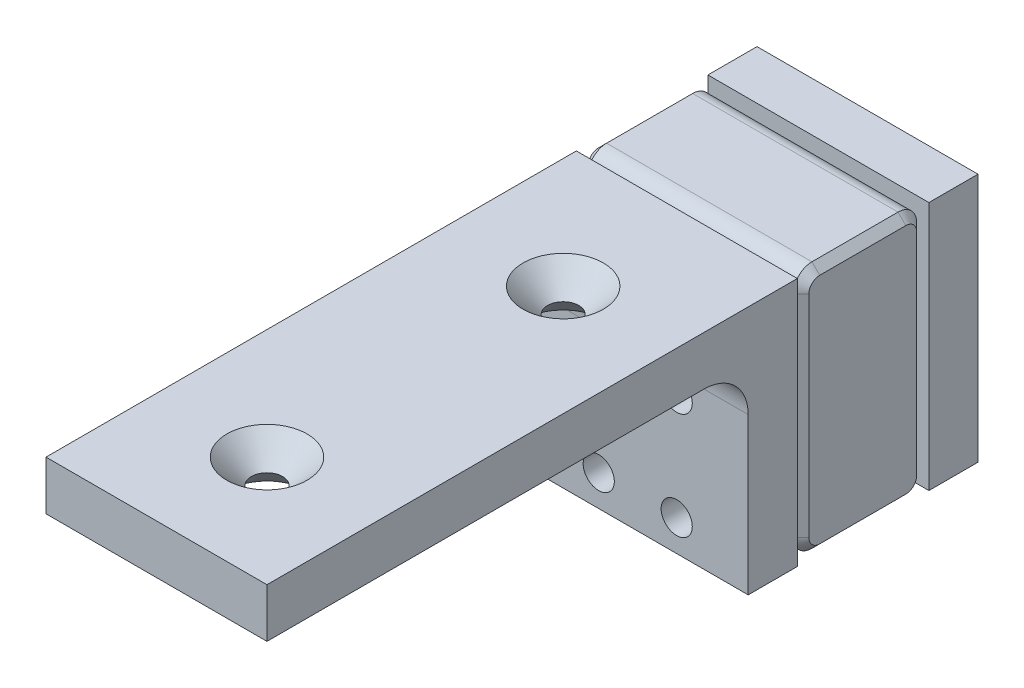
ISO-10303-21;
HEADER;
FILE_DESCRIPTION(('STEP AP214'),'2;1');
FILE_NAME('part.step','',(''),(''),'','','');
FILE_SCHEMA(('AUTOMOTIVE_DESIGN { 1 0 10303 214 1 1 1 1 }'));
ENDSEC;
DATA;
#1=APPLICATION_CONTEXT('core data for automotive mechanical design processes');
#2=APPLICATION_PROTOCOL_DEFINITION('international standard','automotive_design',2000,#1);
#3=PRODUCT_CONTEXT('',#1,'mechanical');
#4=PRODUCT('Part','Part','',(#3));
#5=PRODUCT_RELATED_PRODUCT_CATEGORY('part','',(#4));
#6=PRODUCT_DEFINITION_FORMATION('','',#4);
#7=PRODUCT_DEFINITION_CONTEXT('part definition',#1,'design');
#8=PRODUCT_DEFINITION('design','',#6,#7);
#9=PRODUCT_DEFINITION_SHAPE('','',#8);
#10=(LENGTH_UNIT() NAMED_UNIT(*) SI_UNIT(.MILLI.,.METRE.));
#11=(NAMED_UNIT(*) PLANE_ANGLE_UNIT() SI_UNIT($,.RADIAN.));
#12=(NAMED_UNIT(*) SI_UNIT($,.STERADIAN.) SOLID_ANGLE_UNIT());
#13=UNCERTAINTY_MEASURE_WITH_UNIT(LENGTH_MEASURE(1.E-05),#10,'distance_accuracy_value','');
#14=(GEOMETRIC_REPRESENTATION_CONTEXT(3) GLOBAL_UNCERTAINTY_ASSIGNED_CONTEXT((#13)) GLOBAL_UNIT_ASSIGNED_CONTEXT((#10,
#11,#12)) REPRESENTATION_CONTEXT('',''));
#15=CARTESIAN_POINT('',(0.,0.,0.));
#16=DIRECTION('',(0.,0.,1.));
#17=DIRECTION('',(1.,0.,0.));
#18=AXIS2_PLACEMENT_3D('',#15,#16,#17);
#19=CARTESIAN_POINT('',(0.,0.,-35.908));
#20=DIRECTION('',(0.,0.,1.));
#21=DIRECTION('',(0.,-1.,0.));
#22=AXIS2_PLACEMENT_3D('',#19,#20,#21);
#23=PLANE('',#22);
#24=CARTESIAN_POINT('',(-7.9375,12.7,-35.908));
#25=DIRECTION('',(0.,0.,-1.));
#26=DIRECTION('',(0.,1.,0.));
#27=AXIS2_PLACEMENT_3D('',#24,#25,#26);
#28=CIRCLE('',#27,3.175);
#29=CARTESIAN_POINT('',(-7.9375,15.875,-35.908));
#30=VERTEX_POINT('',#29);
#31=EDGE_CURVE('E215',#30,#30,#28,.T.);
#32=ORIENTED_EDGE('',*,*,#31,.F.);
#33=EDGE_LOOP('',(#32));
#34=FACE_BOUND('',#33,.T.);
#35=CARTESIAN_POINT('',(7.9375,12.7,-35.908));
#36=DIRECTION('',(0.,0.,-1.));
#37=DIRECTION('',(0.,1.,0.));
#38=AXIS2_PLACEMENT_3D('',#35,#36,#37);
#39=CIRCLE('',#38,3.175);
#40=CARTESIAN_POINT('',(7.9375,15.875,-35.908));
#41=VERTEX_POINT('',#40);
#42=EDGE_CURVE('E788',#41,#41,#39,.T.);
#43=ORIENTED_EDGE('',*,*,#42,.F.);
#44=EDGE_LOOP('',(#43));
#45=FACE_BOUND('',#44,.T.);
#46=DIRECTION('',(-1.,0.,0.));
#47=VECTOR('',#46,1.);
#48=CARTESIAN_POINT('',(0.,-11.463,-35.908));
#49=LINE('',#48,#47);
#50=CARTESIAN_POINT('',(-10.0010057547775,-11.463,-35.908));
#51=VERTEX_POINT('',#50);
#52=CARTESIAN_POINT('',(-20.9125,-11.463,-35.908));
#53=VERTEX_POINT('',#52);
#54=EDGE_CURVE('E514',#51,#53,#49,.T.);
#55=ORIENTED_EDGE('',*,*,#54,.T.);
#56=DIRECTION('',(0.,1.,0.));
#57=VECTOR('',#56,1.);
#58=CARTESIAN_POINT('',(-20.9125,0.,-35.908));
#59=LINE('',#58,#57);
#60=CARTESIAN_POINT('',(-20.9125,31.463,-35.908));
#61=VERTEX_POINT('',#60);
#62=EDGE_CURVE('E323',#53,#61,#59,.T.);
#63=ORIENTED_EDGE('',*,*,#62,.T.);
#64=DIRECTION('',(1.,0.,0.));
#65=VECTOR('',#64,1.);
#66=CARTESIAN_POINT('',(0.,31.463,-35.908));
#67=LINE('',#66,#65);
#68=CARTESIAN_POINT('',(20.9125,31.463,-35.908));
#69=VERTEX_POINT('',#68);
#70=EDGE_CURVE('E512',#61,#69,#67,.T.);
#71=ORIENTED_EDGE('',*,*,#70,.T.);
#72=DIRECTION('',(0.,-1.,0.));
#73=VECTOR('',#72,1.);
#74=CARTESIAN_POINT('',(20.9125,0.,-35.908));
#75=LINE('',#74,#73);
#76=CARTESIAN_POINT('',(20.9125,-11.463,-35.908));
#77=VERTEX_POINT('',#76);
#78=EDGE_CURVE('E340',#69,#77,#75,.T.);
#79=ORIENTED_EDGE('',*,*,#78,.T.);
#80=DIRECTION('',(-1.,0.,0.));
#81=VECTOR('',#80,1.);
#82=CARTESIAN_POINT('',(0.,-11.463,-35.908));
#83=LINE('',#82,#81);
#84=CARTESIAN_POINT('',(10.0010057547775,-11.463,-35.908));
#85=VERTEX_POINT('',#84);
#86=EDGE_CURVE('E434',#77,#85,#83,.T.);
#87=ORIENTED_EDGE('',*,*,#86,.T.);
#88=CARTESIAN_POINT('',(7.9375,-9.04999999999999,-35.908));
#89=DIRECTION('',(0.,0.,-1.));
#90=DIRECTION('',(0.,1.,0.));
#91=AXIS2_PLACEMENT_3D('',#88,#89,#90);
#92=CIRCLE('',#91,3.175);
#93=CARTESIAN_POINT('',(5.87399424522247,-11.463,-35.908));
#94=VERTEX_POINT('',#93);
#95=EDGE_CURVE('E522',#94,#85,#92,.T.);
#96=ORIENTED_EDGE('',*,*,#95,.F.);
#97=DIRECTION('',(-1.,0.,0.));
#98=VECTOR('',#97,1.);
#99=CARTESIAN_POINT('',(0.,-11.463,-35.908));
#100=LINE('',#99,#98);
#101=CARTESIAN_POINT('',(-5.87399424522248,-11.463,-35.908));
#102=VERTEX_POINT('',#101);
#103=EDGE_CURVE('E491',#94,#102,#100,.T.);
#104=ORIENTED_EDGE('',*,*,#103,.T.);
#105=CARTESIAN_POINT('',(-7.9375,-9.04999999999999,-35.908));
#106=DIRECTION('',(0.,0.,-1.));
#107=DIRECTION('',(0.,1.,0.));
#108=AXIS2_PLACEMENT_3D('',#105,#106,#107);
#109=CIRCLE('',#108,3.175);
#110=EDGE_CURVE('E214',#51,#102,#109,.T.);
#111=ORIENTED_EDGE('',*,*,#110,.F.);
#112=EDGE_LOOP('',(#55,#63,#71,#79,#87,#96,#104,#111));
#113=FACE_BOUND('',#112,.T.);
#114=ADVANCED_FACE('F58',(#34,#45,#113),#23,.F.);
#115=CARTESIAN_POINT('',(0.,0.,-10.762));
#116=DIRECTION('',(0.,0.,1.));
#117=DIRECTION('',(0.,-1.,0.));
#118=AXIS2_PLACEMENT_3D('',#115,#116,#117);
#119=PLANE('',#118);
#120=CARTESIAN_POINT('',(7.9375,12.7,-10.762));
#121=DIRECTION('',(0.,0.,-1.));
#122=DIRECTION('',(0.,1.,0.));
#123=AXIS2_PLACEMENT_3D('',#120,#121,#122);
#124=CIRCLE('',#123,3.175);
#125=CARTESIAN_POINT('',(7.9375,15.875,-10.762));
#126=VERTEX_POINT('',#125);
#127=EDGE_CURVE('E785',#126,#126,#124,.T.);
#128=ORIENTED_EDGE('',*,*,#127,.T.);
#129=EDGE_LOOP('',(#128));
#130=FACE_BOUND('',#129,.T.);
#131=DIRECTION('',(1.,0.,0.));
#132=VECTOR('',#131,1.);
#133=CARTESIAN_POINT('',(-22.5,31.463,-10.762));
#134=LINE('',#133,#132);
#135=CARTESIAN_POINT('',(20.9125,31.463,-10.762));
#136=VERTEX_POINT('',#135);
#137=CARTESIAN_POINT('',(-20.9125,31.463,-10.762));
#138=VERTEX_POINT('',#137);
#139=EDGE_CURVE('E225',#136,#138,#134,.F.);
#140=ORIENTED_EDGE('',*,*,#139,.T.);
#141=DIRECTION('',(0.,-1.,0.));
#142=VECTOR('',#141,1.);
#143=CARTESIAN_POINT('',(-20.9125,-11.463,-10.762));
#144=LINE('',#143,#142);
#145=CARTESIAN_POINT('',(-20.9125,-11.463,-10.762));
#146=VERTEX_POINT('',#145);
#147=EDGE_CURVE('E358',#138,#146,#144,.T.);
#148=ORIENTED_EDGE('',*,*,#147,.T.);
#149=DIRECTION('',(-1.,0.,0.));
#150=VECTOR('',#149,1.);
#151=CARTESIAN_POINT('',(22.5,-11.463,-10.762));
#152=LINE('',#151,#150);
#153=CARTESIAN_POINT('',(-10.0010057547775,-11.463,-10.762));
#154=VERTEX_POINT('',#153);
#155=EDGE_CURVE('E213',#146,#154,#152,.F.);
#156=ORIENTED_EDGE('',*,*,#155,.T.);
#157=CARTESIAN_POINT('',(-7.9375,-9.05,-10.762));
#158=DIRECTION('',(0.,0.,-1.));
#159=DIRECTION('',(0.,1.,0.));
#160=AXIS2_PLACEMENT_3D('',#157,#158,#159);
#161=CIRCLE('',#160,3.175);
#162=CARTESIAN_POINT('',(-5.87399424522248,-11.463,-10.762));
#163=VERTEX_POINT('',#162);
#164=EDGE_CURVE('E199',#154,#163,#161,.T.);
#165=ORIENTED_EDGE('',*,*,#164,.T.);
#166=DIRECTION('',(-1.,0.,0.));
#167=VECTOR('',#166,1.);
#168=CARTESIAN_POINT('',(22.5,-11.463,-10.762));
#169=LINE('',#168,#167);
#170=CARTESIAN_POINT('',(5.87399424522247,-11.463,-10.762));
#171=VERTEX_POINT('',#170);
#172=EDGE_CURVE('E211',#163,#171,#169,.F.);
#173=ORIENTED_EDGE('',*,*,#172,.T.);
#174=CARTESIAN_POINT('',(7.9375,-9.05,-10.762));
#175=DIRECTION('',(0.,0.,-1.));
#176=DIRECTION('',(0.,1.,0.));
#177=AXIS2_PLACEMENT_3D('',#174,#175,#176);
#178=CIRCLE('',#177,3.175);
#179=CARTESIAN_POINT('',(10.0010057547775,-11.463,-10.762));
#180=VERTEX_POINT('',#179);
#181=EDGE_CURVE('E397',#171,#180,#178,.T.);
#182=ORIENTED_EDGE('',*,*,#181,.T.);
#183=DIRECTION('',(-1.,0.,0.));
#184=VECTOR('',#183,1.);
#185=CARTESIAN_POINT('',(22.5,-11.463,-10.762));
#186=LINE('',#185,#184);
#187=CARTESIAN_POINT('',(20.9125,-11.463,-10.762));
#188=VERTEX_POINT('',#187);
#189=EDGE_CURVE('E221',#180,#188,#186,.F.);
#190=ORIENTED_EDGE('',*,*,#189,.T.);
#191=DIRECTION('',(0.,1.,0.));
#192=VECTOR('',#191,1.);
#193=CARTESIAN_POINT('',(20.9125,31.463,-10.762));
#194=LINE('',#193,#192);
#195=EDGE_CURVE('E356',#188,#136,#194,.T.);
#196=ORIENTED_EDGE('',*,*,#195,.T.);
#197=EDGE_LOOP('',(#140,#148,#156,#165,#173,#182,#190,#196));
#198=FACE_BOUND('',#197,.T.);
#199=CARTESIAN_POINT('',(-7.9375,12.7,-10.762));
#200=DIRECTION('',(0.,0.,-1.));
#201=DIRECTION('',(0.,1.,0.));
#202=AXIS2_PLACEMENT_3D('',#199,#200,#201);
#203=CIRCLE('',#202,3.175);
#204=CARTESIAN_POINT('',(-7.9375,15.875,-10.762));
#205=VERTEX_POINT('',#204);
#206=EDGE_CURVE('E793',#205,#205,#203,.T.);
#207=ORIENTED_EDGE('',*,*,#206,.T.);
#208=EDGE_LOOP('',(#207));
#209=FACE_BOUND('',#208,.T.);
#210=ADVANCED_FACE('F208',(#130,#198,#209),#119,.T.);
#211=CARTESIAN_POINT('',(-22.5,-15.273,-35.908));
#212=DIRECTION('',(1.,0.,0.));
#213=DIRECTION('',(0.,1.,0.));
#214=AXIS2_PLACEMENT_3D('',#211,#212,#213);
#215=PLANE('',#214);
#216=DIRECTION('',(0.,-1.,0.));
#217=VECTOR('',#216,1.);
#218=CARTESIAN_POINT('',(-22.5,-15.273,-34.3205));
#219=LINE('',#218,#217);
#220=CARTESIAN_POINT('',(-22.5,31.463,-34.3205));
#221=VERTEX_POINT('',#220);
#222=CARTESIAN_POINT('',(-22.5,-11.463,-34.3205));
#223=VERTEX_POINT('',#222);
#224=EDGE_CURVE('E310',#221,#223,#219,.T.);
#225=ORIENTED_EDGE('',*,*,#224,.T.);
#226=CARTESIAN_POINT('',(-22.5,-11.463,-32.098));
#227=DIRECTION('',(1.,0.,0.));
#228=DIRECTION('',(0.,1.,0.));
#229=AXIS2_PLACEMENT_3D('',#226,#227,#228);
#230=CIRCLE('',#229,2.22249999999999);
#231=CARTESIAN_POINT('',(-22.5,-13.6855,-32.098));
#232=VERTEX_POINT('',#231);
#233=EDGE_CURVE('E313',#223,#232,#230,.F.);
#234=ORIENTED_EDGE('',*,*,#233,.T.);
#235=DIRECTION('',(0.,0.,1.));
#236=VECTOR('',#235,1.);
#237=CARTESIAN_POINT('',(-22.5,-13.6855,-35.908));
#238=LINE('',#237,#236);
#239=CARTESIAN_POINT('',(-22.5,-13.6855,-14.572));
#240=VERTEX_POINT('',#239);
#241=EDGE_CURVE('E489',#232,#240,#238,.T.);
#242=ORIENTED_EDGE('',*,*,#241,.T.);
#243=CARTESIAN_POINT('',(-22.5,-11.463,-14.572));
#244=DIRECTION('',(1.,0.,0.));
#245=DIRECTION('',(0.,1.,0.));
#246=AXIS2_PLACEMENT_3D('',#243,#244,#245);
#247=CIRCLE('',#246,2.22249999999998);
#248=CARTESIAN_POINT('',(-22.5,-11.463,-12.3495));
#249=VERTEX_POINT('',#248);
#250=EDGE_CURVE('E496',#240,#249,#247,.F.);
#251=ORIENTED_EDGE('',*,*,#250,.T.);
#252=DIRECTION('',(0.,1.,0.));
#253=VECTOR('',#252,1.);
#254=CARTESIAN_POINT('',(-22.5,31.463,-12.3495));
#255=LINE('',#254,#253);
#256=CARTESIAN_POINT('',(-22.5,31.463,-12.3495));
#257=VERTEX_POINT('',#256);
#258=EDGE_CURVE('E460',#249,#257,#255,.T.);
#259=ORIENTED_EDGE('',*,*,#258,.T.);
#260=CARTESIAN_POINT('',(-22.5,31.463,-14.572));
#261=DIRECTION('',(1.,0.,0.));
#262=DIRECTION('',(0.,1.,0.));
#263=AXIS2_PLACEMENT_3D('',#260,#261,#262);
#264=CIRCLE('',#263,2.22249999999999);
#265=CARTESIAN_POINT('',(-22.5,33.6855,-14.572));
#266=VERTEX_POINT('',#265);
#267=EDGE_CURVE('E454',#257,#266,#264,.F.);
#268=ORIENTED_EDGE('',*,*,#267,.T.);
#269=DIRECTION('',(0.,0.,-1.));
#270=VECTOR('',#269,1.);
#271=CARTESIAN_POINT('',(-22.5,33.6855,-35.908));
#272=LINE('',#271,#270);
#273=CARTESIAN_POINT('',(-22.5,33.6855,-32.098));
#274=VERTEX_POINT('',#273);
#275=EDGE_CURVE('E500',#266,#274,#272,.T.);
#276=ORIENTED_EDGE('',*,*,#275,.T.);
#277=CARTESIAN_POINT('',(-22.5,31.463,-32.098));
#278=DIRECTION('',(1.,0.,0.));
#279=DIRECTION('',(0.,1.,0.));
#280=AXIS2_PLACEMENT_3D('',#277,#278,#279);
#281=CIRCLE('',#280,2.22249999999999);
#282=EDGE_CURVE('E315',#274,#221,#281,.F.);
#283=ORIENTED_EDGE('',*,*,#282,.T.);
#284=EDGE_LOOP('',(#225,#234,#242,#251,#259,#268,#276,#283));
#285=FACE_BOUND('',#284,.T.);
#286=ADVANCED_FACE('F289',(#285),#215,.F.);
#287=CARTESIAN_POINT('',(22.5,35.273,-35.908));
#288=DIRECTION('',(0.,-1.,0.));
#289=DIRECTION('',(1.,0.,0.));
#290=AXIS2_PLACEMENT_3D('',#287,#288,#289);
#291=PLANE('',#290);
#292=DIRECTION('',(1.,0.,0.));
#293=VECTOR('',#292,1.);
#294=CARTESIAN_POINT('',(22.5,35.273,-32.098));
#295=LINE('',#294,#293);
#296=CARTESIAN_POINT('',(20.9125,35.273,-32.098));
#297=VERTEX_POINT('',#296);
#298=CARTESIAN_POINT('',(-20.9125,35.273,-32.098));
#299=VERTEX_POINT('',#298);
#300=EDGE_CURVE('E487',#297,#299,#295,.F.);
#301=ORIENTED_EDGE('',*,*,#300,.T.);
#302=DIRECTION('',(0.,0.,1.));
#303=VECTOR('',#302,1.);
#304=CARTESIAN_POINT('',(-20.9125,35.273,-35.908));
#305=LINE('',#304,#303);
#306=CARTESIAN_POINT('',(-20.9125,35.273,-14.572));
#307=VERTEX_POINT('',#306);
#308=EDGE_CURVE('E349',#299,#307,#305,.T.);
#309=ORIENTED_EDGE('',*,*,#308,.T.);
#310=DIRECTION('',(1.,0.,0.));
#311=VECTOR('',#310,1.);
#312=CARTESIAN_POINT('',(22.5,35.273,-14.572));
#313=LINE('',#312,#311);
#314=CARTESIAN_POINT('',(20.9125,35.273,-14.572));
#315=VERTEX_POINT('',#314);
#316=EDGE_CURVE('E483',#307,#315,#313,.T.);
#317=ORIENTED_EDGE('',*,*,#316,.T.);
#318=DIRECTION('',(0.,0.,-1.));
#319=VECTOR('',#318,1.);
#320=CARTESIAN_POINT('',(20.9125,35.273,-35.908));
#321=LINE('',#320,#319);
#322=EDGE_CURVE('E347',#315,#297,#321,.T.);
#323=ORIENTED_EDGE('',*,*,#322,.T.);
#324=EDGE_LOOP('',(#301,#309,#317,#323));
#325=FACE_BOUND('',#324,.T.);
#326=ADVANCED_FACE('F301',(#325),#291,.F.);
#327=CARTESIAN_POINT('',(22.5,-15.273,-35.908));
#328=DIRECTION('',(-1.,0.,0.));
#329=DIRECTION('',(0.,-1.,0.));
#330=AXIS2_PLACEMENT_3D('',#327,#328,#329);
#331=PLANE('',#330);
#332=DIRECTION('',(0.,0.,1.));
#333=VECTOR('',#332,1.);
#334=CARTESIAN_POINT('',(22.5,33.6855,-35.908));
#335=LINE('',#334,#333);
#336=CARTESIAN_POINT('',(22.5,33.6855,-32.098));
#337=VERTEX_POINT('',#336);
#338=CARTESIAN_POINT('',(22.5,33.6855,-14.572));
#339=VERTEX_POINT('',#338);
#340=EDGE_CURVE('E68',#337,#339,#335,.T.);
#341=ORIENTED_EDGE('',*,*,#340,.T.);
#342=CARTESIAN_POINT('',(22.5,31.463,-14.572));
#343=DIRECTION('',(-1.,0.,0.));
#344=DIRECTION('',(0.,-1.,0.));
#345=AXIS2_PLACEMENT_3D('',#342,#343,#344);
#346=CIRCLE('',#345,2.22249999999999);
#347=CARTESIAN_POINT('',(22.5,31.463,-12.3495));
#348=VERTEX_POINT('',#347);
#349=EDGE_CURVE('E12',#339,#348,#346,.F.);
#350=ORIENTED_EDGE('',*,*,#349,.T.);
#351=DIRECTION('',(0.,-1.,0.));
#352=VECTOR('',#351,1.);
#353=CARTESIAN_POINT('',(22.5,-11.463,-12.3495));
#354=LINE('',#353,#352);
#355=CARTESIAN_POINT('',(22.5,-11.463,-12.3495));
#356=VERTEX_POINT('',#355);
#357=EDGE_CURVE('E368',#348,#356,#354,.T.);
#358=ORIENTED_EDGE('',*,*,#357,.T.);
#359=CARTESIAN_POINT('',(22.5,-11.463,-14.572));
#360=DIRECTION('',(-1.,0.,0.));
#361=DIRECTION('',(0.,-1.,0.));
#362=AXIS2_PLACEMENT_3D('',#359,#360,#361);
#363=CIRCLE('',#362,2.22249999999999);
#364=CARTESIAN_POINT('',(22.5,-13.6855,-14.572));
#365=VERTEX_POINT('',#364);
#366=EDGE_CURVE('E370',#356,#365,#363,.F.);
#367=ORIENTED_EDGE('',*,*,#366,.T.);
#368=DIRECTION('',(0.,0.,-1.));
#369=VECTOR('',#368,1.);
#370=CARTESIAN_POINT('',(22.5,-13.6855,-35.908));
#371=LINE('',#370,#369);
#372=CARTESIAN_POINT('',(22.5,-13.6855,-32.098));
#373=VERTEX_POINT('',#372);
#374=EDGE_CURVE('E372',#365,#373,#371,.T.);
#375=ORIENTED_EDGE('',*,*,#374,.T.);
#376=CARTESIAN_POINT('',(22.5,-11.463,-32.098));
#377=DIRECTION('',(-1.,0.,0.));
#378=DIRECTION('',(0.,-1.,0.));
#379=AXIS2_PLACEMENT_3D('',#376,#377,#378);
#380=CIRCLE('',#379,2.2225);
#381=CARTESIAN_POINT('',(22.5,-11.463,-34.3205));
#382=VERTEX_POINT('',#381);
#383=EDGE_CURVE('E374',#373,#382,#380,.F.);
#384=ORIENTED_EDGE('',*,*,#383,.T.);
#385=DIRECTION('',(0.,1.,0.));
#386=VECTOR('',#385,1.);
#387=CARTESIAN_POINT('',(22.5,-15.273,-34.3205));
#388=LINE('',#387,#386);
#389=CARTESIAN_POINT('',(22.5,31.463,-34.3205));
#390=VERTEX_POINT('',#389);
#391=EDGE_CURVE('E376',#382,#390,#388,.T.);
#392=ORIENTED_EDGE('',*,*,#391,.T.);
#393=CARTESIAN_POINT('',(22.5,31.463,-32.098));
#394=DIRECTION('',(-1.,0.,0.));
#395=DIRECTION('',(0.,-1.,0.));
#396=AXIS2_PLACEMENT_3D('',#393,#394,#395);
#397=CIRCLE('',#396,2.2225);
#398=EDGE_CURVE('E79',#390,#337,#397,.F.);
#399=ORIENTED_EDGE('',*,*,#398,.T.);
#400=EDGE_LOOP('',(#341,#350,#358,#367,#375,#384,#392,#399));
#401=FACE_BOUND('',#400,.T.);
#402=ADVANCED_FACE('F297',(#401),#331,.F.);
#403=CARTESIAN_POINT('',(22.5,-15.273,-35.908));
#404=DIRECTION('',(0.,1.,0.));
#405=DIRECTION('',(0.,0.,1.));
#406=AXIS2_PLACEMENT_3D('',#403,#404,#405);
#407=PLANE('',#406);
#408=DIRECTION('',(-1.,0.,0.));
#409=VECTOR('',#408,1.);
#410=CARTESIAN_POINT('',(-22.5,-15.273,-14.572));
#411=LINE('',#410,#409);
#412=CARTESIAN_POINT('',(20.9125,-15.273,-14.572));
#413=VERTEX_POINT('',#412);
#414=CARTESIAN_POINT('',(-20.9125,-15.273,-14.572));
#415=VERTEX_POINT('',#414);
#416=EDGE_CURVE('E438',#413,#415,#411,.T.);
#417=ORIENTED_EDGE('',*,*,#416,.T.);
#418=DIRECTION('',(0.,0.,-1.));
#419=VECTOR('',#418,1.);
#420=CARTESIAN_POINT('',(-20.9125,-15.273,-35.908));
#421=LINE('',#420,#419);
#422=CARTESIAN_POINT('',(-20.9125,-15.273,-32.098));
#423=VERTEX_POINT('',#422);
#424=EDGE_CURVE('E366',#415,#423,#421,.T.);
#425=ORIENTED_EDGE('',*,*,#424,.T.);
#426=DIRECTION('',(-1.,0.,0.));
#427=VECTOR('',#426,1.);
#428=CARTESIAN_POINT('',(22.5,-15.273,-32.098));
#429=LINE('',#428,#427);
#430=CARTESIAN_POINT('',(20.9125,-15.273,-32.098));
#431=VERTEX_POINT('',#430);
#432=EDGE_CURVE('E432',#423,#431,#429,.F.);
#433=ORIENTED_EDGE('',*,*,#432,.T.);
#434=DIRECTION('',(0.,0.,1.));
#435=VECTOR('',#434,1.);
#436=CARTESIAN_POINT('',(20.9125,-15.273,-35.908));
#437=LINE('',#436,#435);
#438=EDGE_CURVE('E364',#431,#413,#437,.T.);
#439=ORIENTED_EDGE('',*,*,#438,.T.);
#440=EDGE_LOOP('',(#417,#425,#433,#439));
#441=FACE_BOUND('',#440,.T.);
#442=ADVANCED_FACE('F280',(#441),#407,.F.);
#443=CARTESIAN_POINT('',(-7.9375,-9.04999999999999,-35.908));
#444=DIRECTION('',(0.,0.,1.));
#445=DIRECTION('',(0.,-1.,0.));
#446=AXIS2_PLACEMENT_3D('',#443,#444,#445);
#447=CYLINDRICAL_SURFACE('',#446,3.175);
#448=ORIENTED_EDGE('',*,*,#110,.T.);
#449=CARTESIAN_POINT('',(-5.87399424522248,-11.463,-35.908));
#450=CARTESIAN_POINT('',(-5.94155645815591,-11.5207884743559,-35.9079943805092));
#451=CARTESIAN_POINT('',(-6.01153962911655,-11.5757102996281,-35.9066851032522));
#452=CARTESIAN_POINT('',(-6.15580037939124,-11.6794577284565,-35.9022018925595));
#453=CARTESIAN_POINT('',(-6.2300765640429,-11.7282852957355,-35.8990285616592));
#454=CARTESIAN_POINT('',(-6.38241512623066,-11.8195160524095,-35.8915591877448));
#455=CARTESIAN_POINT('',(-6.46047725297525,-11.86191966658,-35.8872632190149));
#456=CARTESIAN_POINT('',(-6.61983712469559,-11.940030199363,-35.878222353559));
#457=CARTESIAN_POINT('',(-6.70113508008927,-11.9757366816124,-35.8734774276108));
#458=CARTESIAN_POINT('',(-6.94906315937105,-12.0724181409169,-35.8595174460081));
#459=CARTESIAN_POINT('',(-7.11988959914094,-12.1230520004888,-35.8505666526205));
#460=CARTESIAN_POINT('',(-7.46757184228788,-12.1950461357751,-35.8371930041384));
#461=CARTESIAN_POINT('',(-7.64442292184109,-12.2164288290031,-35.8327666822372));
#462=CARTESIAN_POINT('',(-7.99880368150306,-12.2293399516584,-35.8301404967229));
#463=CARTESIAN_POINT('',(-8.176330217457,-12.2209492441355,-35.8319237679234));
#464=CARTESIAN_POINT('',(-8.52751870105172,-12.1747246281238,-35.8410046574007));
#465=CARTESIAN_POINT('',(-8.70117679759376,-12.1368626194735,-35.848307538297));
#466=CARTESIAN_POINT('',(-9.03866025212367,-12.033136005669,-35.8654625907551));
#467=CARTESIAN_POINT('',(-9.20253475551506,-11.9674277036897,-35.8753004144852));
#468=CARTESIAN_POINT('',(-9.51701393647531,-11.8098113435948,-35.8930038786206));
#469=CARTESIAN_POINT('',(-9.66764763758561,-11.7179625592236,-35.9008739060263));
#470=CARTESIAN_POINT('',(-9.84241787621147,-11.5903900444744,-35.9059451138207));
#471=CARTESIAN_POINT('',(-9.87483487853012,-11.5657546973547,-35.9066977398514));
#472=CARTESIAN_POINT('',(-9.93866765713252,-11.5152791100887,-35.9077249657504));
#473=CARTESIAN_POINT('',(-9.97008447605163,-11.489440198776,-35.9080000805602));
#474=CARTESIAN_POINT('',(-10.0010057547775,-11.463,-35.908));
#475=B_SPLINE_CURVE_WITH_KNOTS('',3,(#449,#450,#451,#452,#453,#454,#455,#456,#457,#458,#459,
#460,#461,#462,#463,#464,#465,#466,#467,#468,#469,#470,#471,#472,#473,#474),.UNSPECIFIED.,.F.,
.F.,(4,2,2,2,2,2,2,2,2,2,2,2,4),(0.,0.266593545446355,0.533100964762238,0.799590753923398,
1.06609790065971,1.59855181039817,2.13059742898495,2.66119914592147,3.19230739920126,
3.72047318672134,4.24745076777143,4.36959913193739,4.49161569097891),.UNSPECIFIED.);
#476=EDGE_CURVE('E204',#102,#51,#475,.T.);
#477=ORIENTED_EDGE('',*,*,#476,.T.);
#478=EDGE_LOOP('',(#448,#477));
#479=FACE_BOUND('',#478,.T.);
#480=ORIENTED_EDGE('',*,*,#164,.F.);
#481=CARTESIAN_POINT('',(-10.0010057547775,-11.463,-10.762));
#482=CARTESIAN_POINT('',(-9.93344354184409,-11.5207884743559,-10.7620056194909));
#483=CARTESIAN_POINT('',(-9.86346037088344,-11.5757102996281,-10.7633148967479));
#484=CARTESIAN_POINT('',(-9.71919962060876,-11.6794577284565,-10.7677981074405));
#485=CARTESIAN_POINT('',(-9.64492343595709,-11.7282852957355,-10.7709714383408));
#486=CARTESIAN_POINT('',(-9.49258487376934,-11.8195160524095,-10.7784408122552));
#487=CARTESIAN_POINT('',(-9.41452274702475,-11.86191966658,-10.7827367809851));
#488=CARTESIAN_POINT('',(-9.25516287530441,-11.940030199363,-10.791777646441));
#489=CARTESIAN_POINT('',(-9.17386491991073,-11.9757366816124,-10.7965225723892));
#490=CARTESIAN_POINT('',(-8.92593684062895,-12.072418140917,-10.8104825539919));
#491=CARTESIAN_POINT('',(-8.75511040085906,-12.1230520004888,-10.8194333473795));
#492=CARTESIAN_POINT('',(-8.40742815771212,-12.1950461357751,-10.8328069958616));
#493=CARTESIAN_POINT('',(-8.23057707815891,-12.2164288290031,-10.8372333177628));
#494=CARTESIAN_POINT('',(-7.87619631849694,-12.2293399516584,-10.8398595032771));
#495=CARTESIAN_POINT('',(-7.698669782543,-12.2209492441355,-10.8380762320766));
#496=CARTESIAN_POINT('',(-7.34748129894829,-12.1747246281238,-10.8289953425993));
#497=CARTESIAN_POINT('',(-7.17382320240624,-12.1368626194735,-10.821692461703));
#498=CARTESIAN_POINT('',(-6.83633974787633,-12.033136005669,-10.8045374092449));
#499=CARTESIAN_POINT('',(-6.67246524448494,-11.9674277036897,-10.7946995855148));
#500=CARTESIAN_POINT('',(-6.35798606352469,-11.8098113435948,-10.7769961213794));
#501=CARTESIAN_POINT('',(-6.20735236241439,-11.7179625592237,-10.7691260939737));
#502=CARTESIAN_POINT('',(-6.03258212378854,-11.5903900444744,-10.7640548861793));
#503=CARTESIAN_POINT('',(-6.00016512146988,-11.5657546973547,-10.7633022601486));
#504=CARTESIAN_POINT('',(-5.93633234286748,-11.5152791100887,-10.7622750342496));
#505=CARTESIAN_POINT('',(-5.90491552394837,-11.489440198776,-10.7619999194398));
#506=CARTESIAN_POINT('',(-5.87399424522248,-11.463,-10.762));
#507=B_SPLINE_CURVE_WITH_KNOTS('',3,(#481,#482,#483,#484,#485,#486,#487,#488,#489,#490,#491,
#492,#493,#494,#495,#496,#497,#498,#499,#500,#501,#502,#503,#504,#505,#506),.UNSPECIFIED.,.F.,
.F.,(4,2,2,2,2,2,2,2,2,2,2,2,4),(0.,0.266593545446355,0.53310096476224,0.799590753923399,
1.06609790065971,1.59855181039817,2.13059742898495,2.66119914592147,3.19230739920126,
3.72047318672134,4.24745076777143,4.36959913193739,4.49161569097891),.UNSPECIFIED.);
#508=EDGE_CURVE('E196',#154,#163,#507,.T.);
#509=ORIENTED_EDGE('',*,*,#508,.T.);
#510=EDGE_LOOP('',(#480,#509));
#511=FACE_BOUND('',#510,.T.);
#512=ADVANCED_FACE('F198',(#479,#511),#447,.F.);
#513=CARTESIAN_POINT('',(-7.9375,12.7,-35.908));
#514=DIRECTION('',(0.,0.,1.));
#515=DIRECTION('',(0.,-1.,0.));
#516=AXIS2_PLACEMENT_3D('',#513,#514,#515);
#517=CYLINDRICAL_SURFACE('',#516,3.175);
#518=ORIENTED_EDGE('',*,*,#31,.T.);
#519=EDGE_LOOP('',(#518));
#520=FACE_BOUND('',#519,.T.);
#521=ORIENTED_EDGE('',*,*,#206,.F.);
#522=EDGE_LOOP('',(#521));
#523=FACE_BOUND('',#522,.T.);
#524=ADVANCED_FACE('F273',(#520,#523),#517,.F.);
#525=CARTESIAN_POINT('',(7.9375,12.7,-35.908));
#526=DIRECTION('',(0.,0.,1.));
#527=DIRECTION('',(0.,-1.,0.));
#528=AXIS2_PLACEMENT_3D('',#525,#526,#527);
#529=CYLINDRICAL_SURFACE('',#528,3.175);
#530=ORIENTED_EDGE('',*,*,#42,.T.);
#531=EDGE_LOOP('',(#530));
#532=FACE_BOUND('',#531,.T.);
#533=ORIENTED_EDGE('',*,*,#127,.F.);
#534=EDGE_LOOP('',(#533));
#535=FACE_BOUND('',#534,.T.);
#536=ADVANCED_FACE('F269',(#532,#535),#529,.F.);
#537=CARTESIAN_POINT('',(7.9375,-9.04999999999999,-35.908));
#538=DIRECTION('',(0.,0.,1.));
#539=DIRECTION('',(0.,-1.,0.));
#540=AXIS2_PLACEMENT_3D('',#537,#538,#539);
#541=CYLINDRICAL_SURFACE('',#540,3.175);
#542=ORIENTED_EDGE('',*,*,#95,.T.);
#543=CARTESIAN_POINT('',(10.0010057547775,-11.463,-35.908));
#544=CARTESIAN_POINT('',(9.93344354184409,-11.5207884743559,-35.9079943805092));
#545=CARTESIAN_POINT('',(9.86346037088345,-11.5757102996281,-35.9066851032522));
#546=CARTESIAN_POINT('',(9.71919962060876,-11.6794577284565,-35.9022018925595));
#547=CARTESIAN_POINT('',(9.6449234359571,-11.7282852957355,-35.8990285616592));
#548=CARTESIAN_POINT('',(9.49258487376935,-11.8195160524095,-35.8915591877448));
#549=CARTESIAN_POINT('',(9.41452274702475,-11.86191966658,-35.8872632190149));
#550=CARTESIAN_POINT('',(9.25516287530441,-11.940030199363,-35.878222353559));
#551=CARTESIAN_POINT('',(9.17386491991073,-11.9757366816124,-35.8734774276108));
#552=CARTESIAN_POINT('',(8.92593684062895,-12.072418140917,-35.8595174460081));
#553=CARTESIAN_POINT('',(8.75511040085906,-12.1230520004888,-35.8505666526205));
#554=CARTESIAN_POINT('',(8.40742815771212,-12.1950461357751,-35.8371930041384));
#555=CARTESIAN_POINT('',(8.23057707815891,-12.2164288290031,-35.8327666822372));
#556=CARTESIAN_POINT('',(7.87619631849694,-12.2293399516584,-35.8301404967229));
#557=CARTESIAN_POINT('',(7.698669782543,-12.2209492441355,-35.8319237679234));
#558=CARTESIAN_POINT('',(7.34748129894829,-12.1747246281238,-35.8410046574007));
#559=CARTESIAN_POINT('',(7.17382320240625,-12.1368626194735,-35.848307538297));
#560=CARTESIAN_POINT('',(6.83633974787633,-12.033136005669,-35.8654625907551));
#561=CARTESIAN_POINT('',(6.67246524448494,-11.9674277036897,-35.8753004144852));
#562=CARTESIAN_POINT('',(6.35798606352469,-11.8098113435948,-35.8930038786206));
#563=CARTESIAN_POINT('',(6.2073523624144,-11.7179625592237,-35.9008739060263));
#564=CARTESIAN_POINT('',(6.03258212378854,-11.5903900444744,-35.9059451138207));
#565=CARTESIAN_POINT('',(6.00016512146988,-11.5657546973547,-35.9066977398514));
#566=CARTESIAN_POINT('',(5.93633234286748,-11.5152791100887,-35.9077249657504));
#567=CARTESIAN_POINT('',(5.90491552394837,-11.489440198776,-35.9080000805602));
#568=CARTESIAN_POINT('',(5.87399424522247,-11.463,-35.908));
#569=B_SPLINE_CURVE_WITH_KNOTS('',3,(#543,#544,#545,#546,#547,#548,#549,#550,#551,#552,#553,
#554,#555,#556,#557,#558,#559,#560,#561,#562,#563,#564,#565,#566,#567,#568),.UNSPECIFIED.,.F.,
.F.,(4,2,2,2,2,2,2,2,2,2,2,2,4),(0.,0.266593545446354,0.53310096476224,0.799590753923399,
1.06609790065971,1.59855181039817,2.13059742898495,2.66119914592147,3.19230739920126,
3.72047318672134,4.24745076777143,4.36959913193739,4.49161569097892),.UNSPECIFIED.);
#570=EDGE_CURVE('E203',#85,#94,#569,.T.);
#571=ORIENTED_EDGE('',*,*,#570,.T.);
#572=EDGE_LOOP('',(#542,#571));
#573=FACE_BOUND('',#572,.T.);
#574=ORIENTED_EDGE('',*,*,#181,.F.);
#575=CARTESIAN_POINT('',(5.87399424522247,-11.463,-10.762));
#576=CARTESIAN_POINT('',(5.94155645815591,-11.5207884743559,-10.7620056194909));
#577=CARTESIAN_POINT('',(6.01153962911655,-11.5757102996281,-10.7633148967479));
#578=CARTESIAN_POINT('',(6.15580037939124,-11.6794577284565,-10.7677981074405));
#579=CARTESIAN_POINT('',(6.2300765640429,-11.7282852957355,-10.7709714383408));
#580=CARTESIAN_POINT('',(6.38241512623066,-11.8195160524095,-10.7784408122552));
#581=CARTESIAN_POINT('',(6.46047725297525,-11.86191966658,-10.7827367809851));
#582=CARTESIAN_POINT('',(6.61983712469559,-11.940030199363,-10.791777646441));
#583=CARTESIAN_POINT('',(6.70113508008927,-11.9757366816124,-10.7965225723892));
#584=CARTESIAN_POINT('',(6.94906315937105,-12.072418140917,-10.8104825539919));
#585=CARTESIAN_POINT('',(7.11988959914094,-12.1230520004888,-10.8194333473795));
#586=CARTESIAN_POINT('',(7.46757184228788,-12.1950461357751,-10.8328069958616));
#587=CARTESIAN_POINT('',(7.64442292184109,-12.2164288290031,-10.8372333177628));
#588=CARTESIAN_POINT('',(7.99880368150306,-12.2293399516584,-10.8398595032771));
#589=CARTESIAN_POINT('',(8.176330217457,-12.2209492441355,-10.8380762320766));
#590=CARTESIAN_POINT('',(8.52751870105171,-12.1747246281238,-10.8289953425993));
#591=CARTESIAN_POINT('',(8.70117679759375,-12.1368626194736,-10.821692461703));
#592=CARTESIAN_POINT('',(9.03866025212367,-12.033136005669,-10.8045374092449));
#593=CARTESIAN_POINT('',(9.20253475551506,-11.9674277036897,-10.7946995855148));
#594=CARTESIAN_POINT('',(9.51701393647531,-11.8098113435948,-10.7769961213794));
#595=CARTESIAN_POINT('',(9.6676476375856,-11.7179625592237,-10.7691260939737));
#596=CARTESIAN_POINT('',(9.84241787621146,-11.5903900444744,-10.7640548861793));
#597=CARTESIAN_POINT('',(9.87483487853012,-11.5657546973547,-10.7633022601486));
#598=CARTESIAN_POINT('',(9.93866765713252,-11.5152791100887,-10.7622750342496));
#599=CARTESIAN_POINT('',(9.97008447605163,-11.489440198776,-10.7619999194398));
#600=CARTESIAN_POINT('',(10.0010057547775,-11.463,-10.762));
#601=B_SPLINE_CURVE_WITH_KNOTS('',3,(#575,#576,#577,#578,#579,#580,#581,#582,#583,#584,#585,
#586,#587,#588,#589,#590,#591,#592,#593,#594,#595,#596,#597,#598,#599,#600),.UNSPECIFIED.,.F.,
.F.,(4,2,2,2,2,2,2,2,2,2,2,2,4),(0.,0.266593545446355,0.533100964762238,0.799590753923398,
1.06609790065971,1.59855181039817,2.13059742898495,2.66119914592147,3.19230739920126,
3.72047318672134,4.24745076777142,4.36959913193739,4.49161569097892),.UNSPECIFIED.);
#602=EDGE_CURVE('E220',#171,#180,#601,.T.);
#603=ORIENTED_EDGE('',*,*,#602,.T.);
#604=EDGE_LOOP('',(#574,#603));
#605=FACE_BOUND('',#604,.T.);
#606=ADVANCED_FACE('F265',(#573,#605),#541,.F.);
#607=CARTESIAN_POINT('',(22.5,-11.463,-14.572));
#608=DIRECTION('',(1.,0.,0.));
#609=DIRECTION('',(0.,0.,-1.));
#610=AXIS2_PLACEMENT_3D('',#607,#608,#609);
#611=CYLINDRICAL_SURFACE('',#610,3.81);
#612=ORIENTED_EDGE('',*,*,#155,.F.);
#613=CARTESIAN_POINT('',(-20.9125,-11.463,-14.572));
#614=DIRECTION('',(1.,0.,0.));
#615=DIRECTION('',(0.,0.,-1.));
#616=AXIS2_PLACEMENT_3D('',#613,#614,#615);
#617=CIRCLE('',#616,3.81);
#618=EDGE_CURVE('E362',#146,#415,#617,.T.);
#619=ORIENTED_EDGE('',*,*,#618,.T.);
#620=ORIENTED_EDGE('',*,*,#416,.F.);
#621=CARTESIAN_POINT('',(20.9125,-11.463,-14.572));
#622=DIRECTION('',(-1.,0.,0.));
#623=DIRECTION('',(0.,0.,1.));
#624=AXIS2_PLACEMENT_3D('',#621,#622,#623);
#625=CIRCLE('',#624,3.81);
#626=EDGE_CURVE('E360',#413,#188,#625,.T.);
#627=ORIENTED_EDGE('',*,*,#626,.T.);
#628=ORIENTED_EDGE('',*,*,#189,.F.);
#629=ORIENTED_EDGE('',*,*,#602,.F.);
#630=ORIENTED_EDGE('',*,*,#172,.F.);
#631=ORIENTED_EDGE('',*,*,#508,.F.);
#632=EDGE_LOOP('',(#612,#619,#620,#627,#628,#629,#630,#631));
#633=FACE_BOUND('',#632,.T.);
#634=ADVANCED_FACE('F218',(#633),#611,.T.);
#635=CARTESIAN_POINT('',(0.,-11.463,-32.098));
#636=DIRECTION('',(-1.,0.,0.));
#637=DIRECTION('',(0.,0.,1.));
#638=AXIS2_PLACEMENT_3D('',#635,#636,#637);
#639=CYLINDRICAL_SURFACE('',#638,3.81);
#640=ORIENTED_EDGE('',*,*,#432,.F.);
#641=CARTESIAN_POINT('',(-20.9125,-11.463,-32.098));
#642=DIRECTION('',(1.,0.,0.));
#643=DIRECTION('',(0.,0.,-1.));
#644=AXIS2_PLACEMENT_3D('',#641,#642,#643);
#645=CIRCLE('',#644,3.81);
#646=EDGE_CURVE('E335',#423,#53,#645,.T.);
#647=ORIENTED_EDGE('',*,*,#646,.T.);
#648=ORIENTED_EDGE('',*,*,#54,.F.);
#649=ORIENTED_EDGE('',*,*,#476,.F.);
#650=ORIENTED_EDGE('',*,*,#103,.F.);
#651=ORIENTED_EDGE('',*,*,#570,.F.);
#652=ORIENTED_EDGE('',*,*,#86,.F.);
#653=CARTESIAN_POINT('',(20.9125,-11.463,-32.098));
#654=DIRECTION('',(-1.,0.,0.));
#655=DIRECTION('',(0.,0.,1.));
#656=AXIS2_PLACEMENT_3D('',#653,#654,#655);
#657=CIRCLE('',#656,3.81);
#658=EDGE_CURVE('E333',#77,#431,#657,.T.);
#659=ORIENTED_EDGE('',*,*,#658,.T.);
#660=EDGE_LOOP('',(#640,#647,#648,#649,#650,#651,#652,#659));
#661=FACE_BOUND('',#660,.T.);
#662=ADVANCED_FACE('F244',(#661),#639,.T.);
#663=CARTESIAN_POINT('',(0.,31.463,-32.098));
#664=DIRECTION('',(1.,0.,0.));
#665=DIRECTION('',(0.,1.,0.));
#666=AXIS2_PLACEMENT_3D('',#663,#664,#665);
#667=CYLINDRICAL_SURFACE('',#666,3.81);
#668=ORIENTED_EDGE('',*,*,#70,.F.);
#669=CARTESIAN_POINT('',(-20.9125,31.463,-32.098));
#670=DIRECTION('',(1.,0.,0.));
#671=DIRECTION('',(0.,0.,-1.));
#672=AXIS2_PLACEMENT_3D('',#669,#670,#671);
#673=CIRCLE('',#672,3.81);
#674=EDGE_CURVE('E345',#61,#299,#673,.T.);
#675=ORIENTED_EDGE('',*,*,#674,.T.);
#676=ORIENTED_EDGE('',*,*,#300,.F.);
#677=CARTESIAN_POINT('',(20.9125,31.463,-32.098));
#678=DIRECTION('',(-1.,0.,0.));
#679=DIRECTION('',(0.,0.,1.));
#680=AXIS2_PLACEMENT_3D('',#677,#678,#679);
#681=CIRCLE('',#680,3.81);
#682=EDGE_CURVE('E343',#297,#69,#681,.T.);
#683=ORIENTED_EDGE('',*,*,#682,.T.);
#684=EDGE_LOOP('',(#668,#675,#676,#683));
#685=FACE_BOUND('',#684,.T.);
#686=ADVANCED_FACE('F248',(#685),#667,.T.);
#687=CARTESIAN_POINT('',(22.5,31.463,-14.572));
#688=DIRECTION('',(-1.,0.,0.));
#689=DIRECTION('',(0.,-1.,0.));
#690=AXIS2_PLACEMENT_3D('',#687,#688,#689);
#691=CYLINDRICAL_SURFACE('',#690,3.81);
#692=ORIENTED_EDGE('',*,*,#316,.F.);
#693=CARTESIAN_POINT('',(-20.9125,31.463,-14.572));
#694=DIRECTION('',(1.,0.,0.));
#695=DIRECTION('',(0.,0.,-1.));
#696=AXIS2_PLACEMENT_3D('',#693,#694,#695);
#697=CIRCLE('',#696,3.81);
#698=EDGE_CURVE('E354',#307,#138,#697,.T.);
#699=ORIENTED_EDGE('',*,*,#698,.T.);
#700=ORIENTED_EDGE('',*,*,#139,.F.);
#701=CARTESIAN_POINT('',(20.9125,31.463,-14.572));
#702=DIRECTION('',(-1.,0.,0.));
#703=DIRECTION('',(0.,0.,1.));
#704=AXIS2_PLACEMENT_3D('',#701,#702,#703);
#705=CIRCLE('',#704,3.81);
#706=EDGE_CURVE('E351',#136,#315,#705,.T.);
#707=ORIENTED_EDGE('',*,*,#706,.T.);
#708=EDGE_LOOP('',(#692,#699,#700,#707));
#709=FACE_BOUND('',#708,.T.);
#710=ADVANCED_FACE('F482',(#709),#691,.T.);
#711=CARTESIAN_POINT('',(-22.5,31.463,-14.572));
#712=DIRECTION('',(1.,0.,0.));
#713=DIRECTION('',(0.,0.,-1.));
#714=AXIS2_PLACEMENT_3D('',#711,#712,#713);
#715=CONICAL_SURFACE('',#714,2.22249999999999,0.785398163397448);
#716=DIRECTION('',(-0.707106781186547,0.,-0.707106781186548));
#717=VECTOR('',#716,1.);
#718=CARTESIAN_POINT('',(-20.9125,31.463,-10.762));
#719=LINE('',#718,#717);
#720=EDGE_CURVE('E391',#138,#257,#719,.T.);
#721=ORIENTED_EDGE('',*,*,#720,.F.);
#722=ORIENTED_EDGE('',*,*,#698,.F.);
#723=DIRECTION('',(0.707106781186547,0.707106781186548,0.));
#724=VECTOR('',#723,1.);
#725=CARTESIAN_POINT('',(-22.5,33.6855,-14.572));
#726=LINE('',#725,#724);
#727=EDGE_CURVE('E394',#266,#307,#726,.T.);
#728=ORIENTED_EDGE('',*,*,#727,.F.);
#729=ORIENTED_EDGE('',*,*,#267,.F.);
#730=EDGE_LOOP('',(#721,#722,#728,#729));
#731=FACE_BOUND('',#730,.T.);
#732=ADVANCED_FACE('F452',(#731),#715,.T.);
#733=CARTESIAN_POINT('',(-20.9125,35.273,-35.908));
#734=DIRECTION('',(0.707106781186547,-0.707106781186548,0.));
#735=DIRECTION('',(0.,0.,1.));
#736=AXIS2_PLACEMENT_3D('',#733,#734,#735);
#737=PLANE('',#736);
#738=ORIENTED_EDGE('',*,*,#727,.T.);
#739=ORIENTED_EDGE('',*,*,#308,.F.);
#740=DIRECTION('',(0.707106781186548,0.707106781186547,0.));
#741=VECTOR('',#740,1.);
#742=CARTESIAN_POINT('',(-22.5,33.6855,-32.098));
#743=LINE('',#742,#741);
#744=EDGE_CURVE('E388',#274,#299,#743,.T.);
#745=ORIENTED_EDGE('',*,*,#744,.F.);
#746=ORIENTED_EDGE('',*,*,#275,.F.);
#747=EDGE_LOOP('',(#738,#739,#745,#746));
#748=FACE_BOUND('',#747,.T.);
#749=ADVANCED_FACE('F504',(#748),#737,.F.);
#750=CARTESIAN_POINT('',(-22.5,-15.273,-12.3495));
#751=DIRECTION('',(-0.707106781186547,0.,0.707106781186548));
#752=DIRECTION('',(0.,-1.,0.));
#753=AXIS2_PLACEMENT_3D('',#750,#751,#752);
#754=PLANE('',#753);
#755=ORIENTED_EDGE('',*,*,#720,.T.);
#756=ORIENTED_EDGE('',*,*,#258,.F.);
#757=DIRECTION('',(-0.707106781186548,0.,-0.707106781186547));
#758=VECTOR('',#757,1.);
#759=CARTESIAN_POINT('',(-20.9125,-11.463,-10.762));
#760=LINE('',#759,#758);
#761=EDGE_CURVE('E385',#146,#249,#760,.T.);
#762=ORIENTED_EDGE('',*,*,#761,.F.);
#763=ORIENTED_EDGE('',*,*,#147,.F.);
#764=EDGE_LOOP('',(#755,#756,#762,#763));
#765=FACE_BOUND('',#764,.T.);
#766=ADVANCED_FACE('F458',(#765),#754,.T.);
#767=CARTESIAN_POINT('',(-22.5,31.463,-32.098));
#768=DIRECTION('',(1.,0.,0.));
#769=DIRECTION('',(0.,0.,-1.));
#770=AXIS2_PLACEMENT_3D('',#767,#768,#769);
#771=CONICAL_SURFACE('',#770,2.22249999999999,0.785398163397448);
#772=ORIENTED_EDGE('',*,*,#744,.T.);
#773=ORIENTED_EDGE('',*,*,#674,.F.);
#774=DIRECTION('',(0.707106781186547,0.,-0.707106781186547));
#775=VECTOR('',#774,1.);
#776=CARTESIAN_POINT('',(-22.5,31.463,-34.3205));
#777=LINE('',#776,#775);
#778=EDGE_CURVE('E383',#221,#61,#777,.T.);
#779=ORIENTED_EDGE('',*,*,#778,.F.);
#780=ORIENTED_EDGE('',*,*,#282,.F.);
#781=EDGE_LOOP('',(#772,#773,#779,#780));
#782=FACE_BOUND('',#781,.T.);
#783=ADVANCED_FACE('F507',(#782),#771,.T.);
#784=CARTESIAN_POINT('',(-22.5,-11.463,-14.572));
#785=DIRECTION('',(1.,0.,0.));
#786=DIRECTION('',(0.,0.,-1.));
#787=AXIS2_PLACEMENT_3D('',#784,#785,#786);
#788=CONICAL_SURFACE('',#787,2.22249999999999,0.785398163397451);
#789=ORIENTED_EDGE('',*,*,#761,.T.);
#790=ORIENTED_EDGE('',*,*,#250,.F.);
#791=DIRECTION('',(-0.707106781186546,0.707106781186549,0.));
#792=VECTOR('',#791,1.);
#793=CARTESIAN_POINT('',(-20.9125,-15.273,-14.572));
#794=LINE('',#793,#792);
#795=EDGE_CURVE('E327',#415,#240,#794,.T.);
#796=ORIENTED_EDGE('',*,*,#795,.F.);
#797=ORIENTED_EDGE('',*,*,#618,.F.);
#798=EDGE_LOOP('',(#789,#790,#796,#797));
#799=FACE_BOUND('',#798,.T.);
#800=ADVANCED_FACE('F464',(#799),#788,.T.);
#801=CARTESIAN_POINT('',(-20.9125,0.,-35.908));
#802=DIRECTION('',(0.707106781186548,0.,0.707106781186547));
#803=DIRECTION('',(0.,1.,0.));
#804=AXIS2_PLACEMENT_3D('',#801,#802,#803);
#805=PLANE('',#804);
#806=ORIENTED_EDGE('',*,*,#778,.T.);
#807=ORIENTED_EDGE('',*,*,#62,.F.);
#808=DIRECTION('',(0.707106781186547,0.,-0.707106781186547));
#809=VECTOR('',#808,1.);
#810=CARTESIAN_POINT('',(-22.5,-11.463,-34.3205));
#811=LINE('',#810,#809);
#812=EDGE_CURVE('E321',#223,#53,#811,.T.);
#813=ORIENTED_EDGE('',*,*,#812,.F.);
#814=ORIENTED_EDGE('',*,*,#224,.F.);
#815=EDGE_LOOP('',(#806,#807,#813,#814));
#816=FACE_BOUND('',#815,.T.);
#817=ADVANCED_FACE('F322',(#816),#805,.F.);
#818=CARTESIAN_POINT('',(-22.5,-13.6855,-35.908));
#819=DIRECTION('',(0.707106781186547,0.707106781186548,0.));
#820=DIRECTION('',(0.,0.,1.));
#821=AXIS2_PLACEMENT_3D('',#818,#819,#820);
#822=PLANE('',#821);
#823=ORIENTED_EDGE('',*,*,#795,.T.);
#824=ORIENTED_EDGE('',*,*,#241,.F.);
#825=DIRECTION('',(-0.707106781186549,0.707106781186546,0.));
#826=VECTOR('',#825,1.);
#827=CARTESIAN_POINT('',(-20.9125,-15.273,-32.098));
#828=LINE('',#827,#826);
#829=EDGE_CURVE('E328',#423,#232,#828,.T.);
#830=ORIENTED_EDGE('',*,*,#829,.F.);
#831=ORIENTED_EDGE('',*,*,#424,.F.);
#832=EDGE_LOOP('',(#823,#824,#830,#831));
#833=FACE_BOUND('',#832,.T.);
#834=ADVANCED_FACE('F525',(#833),#822,.F.);
#835=CARTESIAN_POINT('',(-22.5,-11.463,-32.098));
#836=DIRECTION('',(1.,0.,0.));
#837=DIRECTION('',(0.,0.,-1.));
#838=AXIS2_PLACEMENT_3D('',#835,#836,#837);
#839=CONICAL_SURFACE('',#838,2.22249999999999,0.785398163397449);
#840=ORIENTED_EDGE('',*,*,#812,.T.);
#841=ORIENTED_EDGE('',*,*,#646,.F.);
#842=ORIENTED_EDGE('',*,*,#829,.T.);
#843=ORIENTED_EDGE('',*,*,#233,.F.);
#844=EDGE_LOOP('',(#840,#841,#842,#843));
#845=FACE_BOUND('',#844,.T.);
#846=ADVANCED_FACE('F330',(#845),#839,.T.);
#847=CARTESIAN_POINT('',(22.5,-11.463,-32.098));
#848=DIRECTION('',(-1.,0.,0.));
#849=DIRECTION('',(0.,0.,1.));
#850=AXIS2_PLACEMENT_3D('',#847,#848,#849);
#851=CONICAL_SURFACE('',#850,2.2225,0.785398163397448);
#852=DIRECTION('',(0.707106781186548,0.707106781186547,0.));
#853=VECTOR('',#852,1.);
#854=CARTESIAN_POINT('',(20.9125,-15.273,-32.098));
#855=LINE('',#854,#853);
#856=EDGE_CURVE('E413',#431,#373,#855,.T.);
#857=ORIENTED_EDGE('',*,*,#856,.F.);
#858=ORIENTED_EDGE('',*,*,#658,.F.);
#859=DIRECTION('',(-0.707106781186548,0.,-0.707106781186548));
#860=VECTOR('',#859,1.);
#861=CARTESIAN_POINT('',(22.5,-11.463,-34.3205));
#862=LINE('',#861,#860);
#863=EDGE_CURVE('E63',#382,#77,#862,.T.);
#864=ORIENTED_EDGE('',*,*,#863,.F.);
#865=ORIENTED_EDGE('',*,*,#383,.F.);
#866=EDGE_LOOP('',(#857,#858,#864,#865));
#867=FACE_BOUND('',#866,.T.);
#868=ADVANCED_FACE('F61',(#867),#851,.T.);
#869=CARTESIAN_POINT('',(20.9125,0.,-35.908));
#870=DIRECTION('',(-0.707106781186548,0.,0.707106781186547));
#871=DIRECTION('',(0.,-1.,0.));
#872=AXIS2_PLACEMENT_3D('',#869,#870,#871);
#873=PLANE('',#872);
#874=ORIENTED_EDGE('',*,*,#863,.T.);
#875=ORIENTED_EDGE('',*,*,#78,.F.);
#876=DIRECTION('',(-0.707106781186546,0.,-0.707106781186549));
#877=VECTOR('',#876,1.);
#878=CARTESIAN_POINT('',(22.5,31.463,-34.3205));
#879=LINE('',#878,#877);
#880=EDGE_CURVE('E411',#390,#69,#879,.T.);
#881=ORIENTED_EDGE('',*,*,#880,.F.);
#882=ORIENTED_EDGE('',*,*,#391,.F.);
#883=EDGE_LOOP('',(#874,#875,#881,#882));
#884=FACE_BOUND('',#883,.T.);
#885=ADVANCED_FACE('F424',(#884),#873,.F.);
#886=CARTESIAN_POINT('',(20.9125,-15.273,-35.908));
#887=DIRECTION('',(-0.707106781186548,0.707106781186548,0.));
#888=DIRECTION('',(0.,0.,1.));
#889=AXIS2_PLACEMENT_3D('',#886,#887,#888);
#890=PLANE('',#889);
#891=ORIENTED_EDGE('',*,*,#856,.T.);
#892=ORIENTED_EDGE('',*,*,#374,.F.);
#893=DIRECTION('',(0.707106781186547,0.707106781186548,0.));
#894=VECTOR('',#893,1.);
#895=CARTESIAN_POINT('',(20.9125,-15.273,-14.572));
#896=LINE('',#895,#894);
#897=EDGE_CURVE('E408',#413,#365,#896,.T.);
#898=ORIENTED_EDGE('',*,*,#897,.F.);
#899=ORIENTED_EDGE('',*,*,#438,.F.);
#900=EDGE_LOOP('',(#891,#892,#898,#899));
#901=FACE_BOUND('',#900,.T.);
#902=ADVANCED_FACE('F467',(#901),#890,.F.);
#903=CARTESIAN_POINT('',(22.5,31.463,-32.098));
#904=DIRECTION('',(-1.,0.,0.));
#905=DIRECTION('',(0.,0.,1.));
#906=AXIS2_PLACEMENT_3D('',#903,#904,#905);
#907=CONICAL_SURFACE('',#906,2.2225,0.785398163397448);
#908=ORIENTED_EDGE('',*,*,#880,.T.);
#909=ORIENTED_EDGE('',*,*,#682,.F.);
#910=DIRECTION('',(-0.707106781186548,0.707106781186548,0.));
#911=VECTOR('',#910,1.);
#912=CARTESIAN_POINT('',(22.5,33.6855,-32.098));
#913=LINE('',#912,#911);
#914=EDGE_CURVE('E405',#337,#297,#913,.T.);
#915=ORIENTED_EDGE('',*,*,#914,.F.);
#916=ORIENTED_EDGE('',*,*,#398,.F.);
#917=EDGE_LOOP('',(#908,#909,#915,#916));
#918=FACE_BOUND('',#917,.T.);
#919=ADVANCED_FACE('F590',(#918),#907,.T.);
#920=CARTESIAN_POINT('',(22.5,-11.463,-14.572));
#921=DIRECTION('',(-1.,0.,0.));
#922=DIRECTION('',(0.,0.,1.));
#923=AXIS2_PLACEMENT_3D('',#920,#921,#922);
#924=CONICAL_SURFACE('',#923,2.22249999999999,0.785398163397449);
#925=ORIENTED_EDGE('',*,*,#897,.T.);
#926=ORIENTED_EDGE('',*,*,#366,.F.);
#927=DIRECTION('',(0.707106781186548,0.,-0.707106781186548));
#928=VECTOR('',#927,1.);
#929=CARTESIAN_POINT('',(20.9125,-11.463,-10.762));
#930=LINE('',#929,#928);
#931=EDGE_CURVE('E402',#188,#356,#930,.T.);
#932=ORIENTED_EDGE('',*,*,#931,.F.);
#933=ORIENTED_EDGE('',*,*,#626,.F.);
#934=EDGE_LOOP('',(#925,#926,#932,#933));
#935=FACE_BOUND('',#934,.T.);
#936=ADVANCED_FACE('F471',(#935),#924,.T.);
#937=CARTESIAN_POINT('',(22.5,33.6855,-35.908));
#938=DIRECTION('',(-0.707106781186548,-0.707106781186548,0.));
#939=DIRECTION('',(0.,0.,1.));
#940=AXIS2_PLACEMENT_3D('',#937,#938,#939);
#941=PLANE('',#940);
#942=ORIENTED_EDGE('',*,*,#914,.T.);
#943=ORIENTED_EDGE('',*,*,#322,.F.);
#944=DIRECTION('',(-0.707106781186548,0.707106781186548,0.));
#945=VECTOR('',#944,1.);
#946=CARTESIAN_POINT('',(22.5,33.6855,-14.572));
#947=LINE('',#946,#945);
#948=EDGE_CURVE('E400',#339,#315,#947,.T.);
#949=ORIENTED_EDGE('',*,*,#948,.F.);
#950=ORIENTED_EDGE('',*,*,#340,.F.);
#951=EDGE_LOOP('',(#942,#943,#949,#950));
#952=FACE_BOUND('',#951,.T.);
#953=ADVANCED_FACE('F578',(#952),#941,.F.);
#954=CARTESIAN_POINT('',(22.5,-15.273,-12.3495));
#955=DIRECTION('',(0.707106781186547,0.,0.707106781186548));
#956=DIRECTION('',(0.,1.,0.));
#957=AXIS2_PLACEMENT_3D('',#954,#955,#956);
#958=PLANE('',#957);
#959=ORIENTED_EDGE('',*,*,#931,.T.);
#960=ORIENTED_EDGE('',*,*,#357,.F.);
#961=DIRECTION('',(0.707106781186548,0.,-0.707106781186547));
#962=VECTOR('',#961,1.);
#963=CARTESIAN_POINT('',(20.9125,31.463,-10.762));
#964=LINE('',#963,#962);
#965=EDGE_CURVE('E398',#136,#348,#964,.T.);
#966=ORIENTED_EDGE('',*,*,#965,.F.);
#967=ORIENTED_EDGE('',*,*,#195,.F.);
#968=EDGE_LOOP('',(#959,#960,#966,#967));
#969=FACE_BOUND('',#968,.T.);
#970=ADVANCED_FACE('F475',(#969),#958,.T.);
#971=CARTESIAN_POINT('',(22.5,31.463,-14.572));
#972=DIRECTION('',(-1.,0.,0.));
#973=DIRECTION('',(0.,0.,1.));
#974=AXIS2_PLACEMENT_3D('',#971,#972,#973);
#975=CONICAL_SURFACE('',#974,2.22249999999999,0.785398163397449);
#976=ORIENTED_EDGE('',*,*,#948,.T.);
#977=ORIENTED_EDGE('',*,*,#706,.F.);
#978=ORIENTED_EDGE('',*,*,#965,.T.);
#979=ORIENTED_EDGE('',*,*,#349,.F.);
#980=EDGE_LOOP('',(#976,#977,#978,#979));
#981=FACE_BOUND('',#980,.T.);
#982=ADVANCED_FACE('F478',(#981),#975,.T.);
#983=CLOSED_SHELL('',(#114,#210,#286,#326,#402,#442,#512,#524,#536,#606,#634,#662,#686,#710,
#732,#749,#766,#783,#800,#817,#834,#846,#868,#885,#902,#919,#936,#953,#970,#982));
#984=MANIFOLD_SOLID_BREP('B2',#983);
#985=CARTESIAN_POINT('',(0.,0.,-46.797));
#986=DIRECTION('',(0.,0.,-1.));
#987=DIRECTION('',(0.,1.,0.));
#988=AXIS2_PLACEMENT_3D('',#985,#986,#987);
#989=PLANE('',#988);
#990=CARTESIAN_POINT('',(7.9375,12.7,-46.797));
#991=DIRECTION('',(0.,0.,-1.));
#992=DIRECTION('',(0.,1.,0.));
#993=AXIS2_PLACEMENT_3D('',#990,#991,#992);
#994=CIRCLE('',#993,3.175);
#995=CARTESIAN_POINT('',(7.9375,15.875,-46.797));
#996=VERTEX_POINT('',#995);
#997=EDGE_CURVE('E903',#996,#996,#994,.T.);
#998=ORIENTED_EDGE('',*,*,#997,.F.);
#999=EDGE_LOOP('',(#998));
#1000=FACE_BOUND('',#999,.T.);
#1001=CARTESIAN_POINT('',(-7.9375,-9.04999999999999,-46.797));
#1002=DIRECTION('',(0.,0.,-1.));
#1003=DIRECTION('',(0.,1.,0.));
#1004=AXIS2_PLACEMENT_3D('',#1001,#1002,#1003);
#1005=CIRCLE('',#1004,3.175);
#1006=CARTESIAN_POINT('',(-7.9375,-5.87499999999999,-46.797));
#1007=VERTEX_POINT('',#1006);
#1008=EDGE_CURVE('E882',#1007,#1007,#1005,.T.);
#1009=ORIENTED_EDGE('',*,*,#1008,.F.);
#1010=EDGE_LOOP('',(#1009));
#1011=FACE_BOUND('',#1010,.T.);
#1012=DIRECTION('',(-1.,0.,0.));
#1013=VECTOR('',#1012,1.);
#1014=CARTESIAN_POINT('',(22.5,-15.4,-46.797));
#1015=LINE('',#1014,#1013);
#1016=CARTESIAN_POINT('',(22.5,-15.4,-46.797));
#1017=VERTEX_POINT('',#1016);
#1018=CARTESIAN_POINT('',(-22.5,-15.4,-46.797));
#1019=VERTEX_POINT('',#1018);
#1020=EDGE_CURVE('E867',#1017,#1019,#1015,.T.);
#1021=ORIENTED_EDGE('',*,*,#1020,.T.);
#1022=DIRECTION('',(0.,1.,0.));
#1023=VECTOR('',#1022,1.);
#1024=CARTESIAN_POINT('',(-22.5,-15.4,-46.797));
#1025=LINE('',#1024,#1023);
#1026=CARTESIAN_POINT('',(-22.5,35.4,-46.797));
#1027=VERTEX_POINT('',#1026);
#1028=EDGE_CURVE('E862',#1019,#1027,#1025,.T.);
#1029=ORIENTED_EDGE('',*,*,#1028,.T.);
#1030=DIRECTION('',(1.,0.,0.));
#1031=VECTOR('',#1030,1.);
#1032=CARTESIAN_POINT('',(-22.5,35.4,-46.797));
#1033=LINE('',#1032,#1031);
#1034=CARTESIAN_POINT('',(22.5,35.4,-46.797));
#1035=VERTEX_POINT('',#1034);
#1036=EDGE_CURVE('E865',#1027,#1035,#1033,.T.);
#1037=ORIENTED_EDGE('',*,*,#1036,.T.);
#1038=DIRECTION('',(0.,-1.,0.));
#1039=VECTOR('',#1038,1.);
#1040=CARTESIAN_POINT('',(22.5,35.4,-46.797));
#1041=LINE('',#1040,#1039);
#1042=EDGE_CURVE('E832',#1035,#1017,#1041,.T.);
#1043=ORIENTED_EDGE('',*,*,#1042,.T.);
#1044=EDGE_LOOP('',(#1021,#1029,#1037,#1043));
#1045=FACE_BOUND('',#1044,.T.);
#1046=CARTESIAN_POINT('',(7.9375,-9.04999999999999,-46.797));
#1047=DIRECTION('',(0.,0.,-1.));
#1048=DIRECTION('',(0.,1.,0.));
#1049=AXIS2_PLACEMENT_3D('',#1046,#1047,#1048);
#1050=CIRCLE('',#1049,3.175);
#1051=CARTESIAN_POINT('',(7.9375,-5.87499999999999,-46.797));
#1052=VERTEX_POINT('',#1051);
#1053=EDGE_CURVE('E897',#1052,#1052,#1050,.T.);
#1054=ORIENTED_EDGE('',*,*,#1053,.F.);
#1055=EDGE_LOOP('',(#1054));
#1056=FACE_BOUND('',#1055,.T.);
#1057=CARTESIAN_POINT('',(-7.9375,12.7,-46.797));
#1058=DIRECTION('',(0.,0.,-1.));
#1059=DIRECTION('',(0.,1.,0.));
#1060=AXIS2_PLACEMENT_3D('',#1057,#1058,#1059);
#1061=CIRCLE('',#1060,3.175);
#1062=CARTESIAN_POINT('',(-7.9375,15.875,-46.797));
#1063=VERTEX_POINT('',#1062);
#1064=EDGE_CURVE('E909',#1063,#1063,#1061,.T.);
#1065=ORIENTED_EDGE('',*,*,#1064,.F.);
#1066=EDGE_LOOP('',(#1065));
#1067=FACE_BOUND('',#1066,.T.);
#1068=ADVANCED_FACE('F815',(#1000,#1011,#1045,#1056,#1067),#989,.T.);
#1069=CARTESIAN_POINT('',(0.,0.,-36.797));
#1070=DIRECTION('',(0.,0.,-1.));
#1071=DIRECTION('',(0.,1.,0.));
#1072=AXIS2_PLACEMENT_3D('',#1069,#1070,#1071);
#1073=PLANE('',#1072);
#1074=DIRECTION('',(-1.,0.,0.));
#1075=VECTOR('',#1074,1.);
#1076=CARTESIAN_POINT('',(22.5,-15.4,-36.797));
#1077=LINE('',#1076,#1075);
#1078=CARTESIAN_POINT('',(22.5,-15.4,-36.797));
#1079=VERTEX_POINT('',#1078);
#1080=CARTESIAN_POINT('',(-22.5,-15.4,-36.797));
#1081=VERTEX_POINT('',#1080);
#1082=EDGE_CURVE('E879',#1079,#1081,#1077,.T.);
#1083=ORIENTED_EDGE('',*,*,#1082,.F.);
#1084=DIRECTION('',(0.,-1.,0.));
#1085=VECTOR('',#1084,1.);
#1086=CARTESIAN_POINT('',(22.5,35.4,-36.797));
#1087=LINE('',#1086,#1085);
#1088=CARTESIAN_POINT('',(22.5,35.4,-36.797));
#1089=VERTEX_POINT('',#1088);
#1090=EDGE_CURVE('E855',#1089,#1079,#1087,.T.);
#1091=ORIENTED_EDGE('',*,*,#1090,.F.);
#1092=DIRECTION('',(1.,0.,0.));
#1093=VECTOR('',#1092,1.);
#1094=CARTESIAN_POINT('',(-22.5,35.4,-36.797));
#1095=LINE('',#1094,#1093);
#1096=CARTESIAN_POINT('',(-22.5,35.4,-36.797));
#1097=VERTEX_POINT('',#1096);
#1098=EDGE_CURVE('E849',#1097,#1089,#1095,.T.);
#1099=ORIENTED_EDGE('',*,*,#1098,.F.);
#1100=DIRECTION('',(0.,1.,0.));
#1101=VECTOR('',#1100,1.);
#1102=CARTESIAN_POINT('',(-22.5,-15.4,-36.797));
#1103=LINE('',#1102,#1101);
#1104=EDGE_CURVE('E871',#1081,#1097,#1103,.T.);
#1105=ORIENTED_EDGE('',*,*,#1104,.F.);
#1106=EDGE_LOOP('',(#1083,#1091,#1099,#1105));
#1107=FACE_BOUND('',#1106,.T.);
#1108=CARTESIAN_POINT('',(-7.9375,-9.04999999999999,-36.797));
#1109=DIRECTION('',(0.,0.,-1.));
#1110=DIRECTION('',(0.,1.,0.));
#1111=AXIS2_PLACEMENT_3D('',#1108,#1109,#1110);
#1112=CIRCLE('',#1111,3.175);
#1113=CARTESIAN_POINT('',(-7.9375,-5.87499999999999,-36.797));
#1114=VERTEX_POINT('',#1113);
#1115=EDGE_CURVE('E894',#1114,#1114,#1112,.T.);
#1116=ORIENTED_EDGE('',*,*,#1115,.T.);
#1117=EDGE_LOOP('',(#1116));
#1118=FACE_BOUND('',#1117,.T.);
#1119=CARTESIAN_POINT('',(7.9375,-9.04999999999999,-36.797));
#1120=DIRECTION('',(0.,0.,-1.));
#1121=DIRECTION('',(0.,1.,0.));
#1122=AXIS2_PLACEMENT_3D('',#1119,#1120,#1121);
#1123=CIRCLE('',#1122,3.175);
#1124=CARTESIAN_POINT('',(7.9375,-5.87499999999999,-36.797));
#1125=VERTEX_POINT('',#1124);
#1126=EDGE_CURVE('E900',#1125,#1125,#1123,.T.);
#1127=ORIENTED_EDGE('',*,*,#1126,.T.);
#1128=EDGE_LOOP('',(#1127));
#1129=FACE_BOUND('',#1128,.T.);
#1130=CARTESIAN_POINT('',(7.9375,12.7,-36.797));
#1131=DIRECTION('',(0.,0.,-1.));
#1132=DIRECTION('',(0.,1.,0.));
#1133=AXIS2_PLACEMENT_3D('',#1130,#1131,#1132);
#1134=CIRCLE('',#1133,3.175);
#1135=CARTESIAN_POINT('',(7.9375,15.875,-36.797));
#1136=VERTEX_POINT('',#1135);
#1137=EDGE_CURVE('E906',#1136,#1136,#1134,.T.);
#1138=ORIENTED_EDGE('',*,*,#1137,.T.);
#1139=EDGE_LOOP('',(#1138));
#1140=FACE_BOUND('',#1139,.T.);
#1141=CARTESIAN_POINT('',(-7.9375,12.7,-36.797));
#1142=DIRECTION('',(0.,0.,-1.));
#1143=DIRECTION('',(0.,1.,0.));
#1144=AXIS2_PLACEMENT_3D('',#1141,#1142,#1143);
#1145=CIRCLE('',#1144,3.175);
#1146=CARTESIAN_POINT('',(-7.9375,15.875,-36.797));
#1147=VERTEX_POINT('',#1146);
#1148=EDGE_CURVE('E912',#1147,#1147,#1145,.T.);
#1149=ORIENTED_EDGE('',*,*,#1148,.T.);
#1150=EDGE_LOOP('',(#1149));
#1151=FACE_BOUND('',#1150,.T.);
#1152=ADVANCED_FACE('F890',(#1107,#1118,#1129,#1140,#1151),#1073,.F.);
#1153=CARTESIAN_POINT('',(22.5,-15.4,-46.797));
#1154=DIRECTION('',(0.,1.,0.));
#1155=DIRECTION('',(0.,0.,1.));
#1156=AXIS2_PLACEMENT_3D('',#1153,#1154,#1155);
#1157=PLANE('',#1156);
#1158=ORIENTED_EDGE('',*,*,#1082,.T.);
#1159=DIRECTION('',(0.,0.,1.));
#1160=VECTOR('',#1159,1.);
#1161=CARTESIAN_POINT('',(-22.5,-15.4,-46.797));
#1162=LINE('',#1161,#1160);
#1163=EDGE_CURVE('E56',#1019,#1081,#1162,.T.);
#1164=ORIENTED_EDGE('',*,*,#1163,.F.);
#1165=ORIENTED_EDGE('',*,*,#1020,.F.);
#1166=DIRECTION('',(0.,0.,1.));
#1167=VECTOR('',#1166,1.);
#1168=CARTESIAN_POINT('',(22.5,-15.4,-46.797));
#1169=LINE('',#1168,#1167);
#1170=EDGE_CURVE('E875',#1017,#1079,#1169,.T.);
#1171=ORIENTED_EDGE('',*,*,#1170,.T.);
#1172=EDGE_LOOP('',(#1158,#1164,#1165,#1171));
#1173=FACE_BOUND('',#1172,.T.);
#1174=ADVANCED_FACE('F817',(#1173),#1157,.F.);
#1175=CARTESIAN_POINT('',(-22.5,-15.4,-46.797));
#1176=DIRECTION('',(1.,0.,0.));
#1177=DIRECTION('',(0.,0.,-1.));
#1178=AXIS2_PLACEMENT_3D('',#1175,#1176,#1177);
#1179=PLANE('',#1178);
#1180=ORIENTED_EDGE('',*,*,#1104,.T.);
#1181=DIRECTION('',(0.,0.,1.));
#1182=VECTOR('',#1181,1.);
#1183=CARTESIAN_POINT('',(-22.5,35.4,-46.797));
#1184=LINE('',#1183,#1182);
#1185=EDGE_CURVE('E824',#1027,#1097,#1184,.T.);
#1186=ORIENTED_EDGE('',*,*,#1185,.F.);
#1187=ORIENTED_EDGE('',*,*,#1028,.F.);
#1188=ORIENTED_EDGE('',*,*,#1163,.T.);
#1189=EDGE_LOOP('',(#1180,#1186,#1187,#1188));
#1190=FACE_BOUND('',#1189,.T.);
#1191=ADVANCED_FACE('F870',(#1190),#1179,.F.);
#1192=CARTESIAN_POINT('',(-22.5,35.4,-46.797));
#1193=DIRECTION('',(0.,-1.,0.));
#1194=DIRECTION('',(0.,0.,-1.));
#1195=AXIS2_PLACEMENT_3D('',#1192,#1193,#1194);
#1196=PLANE('',#1195);
#1197=ORIENTED_EDGE('',*,*,#1098,.T.);
#1198=DIRECTION('',(0.,0.,1.));
#1199=VECTOR('',#1198,1.);
#1200=CARTESIAN_POINT('',(22.5,35.4,-46.797));
#1201=LINE('',#1200,#1199);
#1202=EDGE_CURVE('E872',#1035,#1089,#1201,.T.);
#1203=ORIENTED_EDGE('',*,*,#1202,.F.);
#1204=ORIENTED_EDGE('',*,*,#1036,.F.);
#1205=ORIENTED_EDGE('',*,*,#1185,.T.);
#1206=EDGE_LOOP('',(#1197,#1203,#1204,#1205));
#1207=FACE_BOUND('',#1206,.T.);
#1208=ADVANCED_FACE('F873',(#1207),#1196,.F.);
#1209=CARTESIAN_POINT('',(22.5,35.4,-46.797));
#1210=DIRECTION('',(-1.,0.,0.));
#1211=DIRECTION('',(0.,0.,1.));
#1212=AXIS2_PLACEMENT_3D('',#1209,#1210,#1211);
#1213=PLANE('',#1212);
#1214=ORIENTED_EDGE('',*,*,#1090,.T.);
#1215=ORIENTED_EDGE('',*,*,#1170,.F.);
#1216=ORIENTED_EDGE('',*,*,#1042,.F.);
#1217=ORIENTED_EDGE('',*,*,#1202,.T.);
#1218=EDGE_LOOP('',(#1214,#1215,#1216,#1217));
#1219=FACE_BOUND('',#1218,.T.);
#1220=ADVANCED_FACE('F887',(#1219),#1213,.F.);
#1221=CARTESIAN_POINT('',(-7.9375,-9.04999999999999,-46.797));
#1222=DIRECTION('',(0.,0.,1.));
#1223=DIRECTION('',(0.,-1.,0.));
#1224=AXIS2_PLACEMENT_3D('',#1221,#1222,#1223);
#1225=CYLINDRICAL_SURFACE('',#1224,3.175);
#1226=ORIENTED_EDGE('',*,*,#1008,.T.);
#1227=EDGE_LOOP('',(#1226));
#1228=FACE_BOUND('',#1227,.T.);
#1229=ORIENTED_EDGE('',*,*,#1115,.F.);
#1230=EDGE_LOOP('',(#1229));
#1231=FACE_BOUND('',#1230,.T.);
#1232=ADVANCED_FACE('F931',(#1228,#1231),#1225,.F.);
#1233=CARTESIAN_POINT('',(7.9375,-9.04999999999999,-46.797));
#1234=DIRECTION('',(0.,0.,1.));
#1235=DIRECTION('',(0.,-1.,0.));
#1236=AXIS2_PLACEMENT_3D('',#1233,#1234,#1235);
#1237=CYLINDRICAL_SURFACE('',#1236,3.175);
#1238=ORIENTED_EDGE('',*,*,#1053,.T.);
#1239=EDGE_LOOP('',(#1238));
#1240=FACE_BOUND('',#1239,.T.);
#1241=ORIENTED_EDGE('',*,*,#1126,.F.);
#1242=EDGE_LOOP('',(#1241));
#1243=FACE_BOUND('',#1242,.T.);
#1244=ADVANCED_FACE('F976',(#1240,#1243),#1237,.F.);
#1245=CARTESIAN_POINT('',(7.9375,12.7,-46.797));
#1246=DIRECTION('',(0.,0.,1.));
#1247=DIRECTION('',(0.,-1.,0.));
#1248=AXIS2_PLACEMENT_3D('',#1245,#1246,#1247);
#1249=CYLINDRICAL_SURFACE('',#1248,3.175);
#1250=ORIENTED_EDGE('',*,*,#997,.T.);
#1251=EDGE_LOOP('',(#1250));
#1252=FACE_BOUND('',#1251,.T.);
#1253=ORIENTED_EDGE('',*,*,#1137,.F.);
#1254=EDGE_LOOP('',(#1253));
#1255=FACE_BOUND('',#1254,.T.);
#1256=ADVANCED_FACE('F984',(#1252,#1255),#1249,.F.);
#1257=CARTESIAN_POINT('',(-7.9375,12.7,-46.797));
#1258=DIRECTION('',(0.,0.,1.));
#1259=DIRECTION('',(0.,-1.,0.));
#1260=AXIS2_PLACEMENT_3D('',#1257,#1258,#1259);
#1261=CYLINDRICAL_SURFACE('',#1260,3.175);
#1262=ORIENTED_EDGE('',*,*,#1064,.T.);
#1263=EDGE_LOOP('',(#1262));
#1264=FACE_BOUND('',#1263,.T.);
#1265=ORIENTED_EDGE('',*,*,#1148,.F.);
#1266=EDGE_LOOP('',(#1265));
#1267=FACE_BOUND('',#1266,.T.);
#1268=ADVANCED_FACE('F918',(#1264,#1267),#1261,.F.);
#1269=CLOSED_SHELL('',(#1068,#1152,#1174,#1191,#1208,#1220,#1232,#1244,#1256,#1268));
#1270=MANIFOLD_SOLID_BREP('B6',#1269);
#1271=CARTESIAN_POINT('',(22.5,25.4,0.));
#1272=DIRECTION('',(0.,0.,-1.));
#1273=DIRECTION('',(0.,1.,0.));
#1274=AXIS2_PLACEMENT_3D('',#1271,#1272,#1273);
#1275=PLANE('',#1274);
#1276=CARTESIAN_POINT('',(-7.9375,12.7,0.));
#1277=DIRECTION('',(0.,0.,1.));
#1278=DIRECTION('',(1.,0.,0.));
#1279=AXIS2_PLACEMENT_3D('',#1276,#1277,#1278);
#1280=CIRCLE('',#1279,3.175);
#1281=CARTESIAN_POINT('',(-4.7625,12.7,0.));
#1282=VERTEX_POINT('',#1281);
#1283=EDGE_CURVE('E1276',#1282,#1282,#1280,.T.);
#1284=ORIENTED_EDGE('',*,*,#1283,.F.);
#1285=EDGE_LOOP('',(#1284));
#1286=FACE_BOUND('',#1285,.T.);
#1287=CARTESIAN_POINT('',(7.9375,12.7,0.));
#1288=DIRECTION('',(0.,0.,1.));
#1289=DIRECTION('',(1.,0.,0.));
#1290=AXIS2_PLACEMENT_3D('',#1287,#1288,#1289);
#1291=CIRCLE('',#1290,3.175);
#1292=CARTESIAN_POINT('',(11.1125,12.7,0.));
#1293=VERTEX_POINT('',#1292);
#1294=EDGE_CURVE('E1280',#1293,#1293,#1291,.T.);
#1295=ORIENTED_EDGE('',*,*,#1294,.F.);
#1296=EDGE_LOOP('',(#1295));
#1297=FACE_BOUND('',#1296,.T.);
#1298=CARTESIAN_POINT('',(7.9375,-9.05,0.));
#1299=DIRECTION('',(0.,0.,1.));
#1300=DIRECTION('',(1.,0.,0.));
#1301=AXIS2_PLACEMENT_3D('',#1298,#1299,#1300);
#1302=CIRCLE('',#1301,3.175);
#1303=CARTESIAN_POINT('',(11.1125,-9.05,0.));
#1304=VERTEX_POINT('',#1303);
#1305=EDGE_CURVE('E1284',#1304,#1304,#1302,.T.);
#1306=ORIENTED_EDGE('',*,*,#1305,.F.);
#1307=EDGE_LOOP('',(#1306));
#1308=FACE_BOUND('',#1307,.T.);
#1309=CARTESIAN_POINT('',(-7.9375,-9.05,0.));
#1310=DIRECTION('',(0.,0.,1.));
#1311=DIRECTION('',(1.,0.,0.));
#1312=AXIS2_PLACEMENT_3D('',#1309,#1310,#1311);
#1313=CIRCLE('',#1312,3.175);
#1314=CARTESIAN_POINT('',(-4.7625,-9.05,0.));
#1315=VERTEX_POINT('',#1314);
#1316=EDGE_CURVE('E1287',#1315,#1315,#1313,.T.);
#1317=ORIENTED_EDGE('',*,*,#1316,.F.);
#1318=EDGE_LOOP('',(#1317));
#1319=FACE_BOUND('',#1318,.T.);
#1320=DIRECTION('',(0.,-1.,0.));
#1321=VECTOR('',#1320,1.);
#1322=CARTESIAN_POINT('',(22.5,25.4,0.));
#1323=LINE('',#1322,#1321);
#1324=CARTESIAN_POINT('',(22.5,16.4,0.));
#1325=VERTEX_POINT('',#1324);
#1326=CARTESIAN_POINT('',(22.5,-15.4,0.));
#1327=VERTEX_POINT('',#1326);
#1328=EDGE_CURVE('E1102',#1325,#1327,#1323,.T.);
#1329=ORIENTED_EDGE('',*,*,#1328,.F.);
#1330=DIRECTION('',(-1.,0.,0.));
#1331=VECTOR('',#1330,1.);
#1332=CARTESIAN_POINT('',(-22.5,16.4,0.));
#1333=LINE('',#1332,#1331);
#1334=CARTESIAN_POINT('',(5.35723809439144,16.4,0.));
#1335=VERTEX_POINT('',#1334);
#1336=EDGE_CURVE('E1187',#1325,#1335,#1333,.T.);
#1337=ORIENTED_EDGE('',*,*,#1336,.T.);
#1338=CARTESIAN_POINT('',(9.24901988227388,16.8957939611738,0.));
#1339=CARTESIAN_POINT('',(6.25475108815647,27.2889621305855,0.));
#1340=CARTESIAN_POINT('',(6.79896054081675,25.4,10.6357533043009));
#1341=CARTESIAN_POINT('',(9.06626007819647,16.8431271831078,0.));
#1342=CARTESIAN_POINT('',(6.26988411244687,27.2134509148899,0.));
#1343=CARTESIAN_POINT('',(6.75751649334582,25.4,10.573727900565));
#1344=CARTESIAN_POINT('',(8.88217660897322,16.7951507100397,0.));
#1345=CARTESIAN_POINT('',(6.2779409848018,27.1337350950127,0.));
#1346=CARTESIAN_POINT('',(6.71327026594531,25.4,10.5092470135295));
#1347=CARTESIAN_POINT('',(8.51196347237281,16.7082027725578,0.));
#1348=CARTESIAN_POINT('',(6.27821229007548,26.9677907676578,0.));
#1349=CARTESIAN_POINT('',(6.61818344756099,25.4,10.3752978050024));
#1350=CARTESIAN_POINT('',(8.3258345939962,16.6692279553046,0.));
#1351=CARTESIAN_POINT('',(6.27057159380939,26.8816672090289,0.));
#1352=CARTESIAN_POINT('',(6.56734532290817,25.4,10.3058313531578));
#1353=CARTESIAN_POINT('',(7.95259994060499,16.5999813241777,0.));
#1354=CARTESIAN_POINT('',(6.23831928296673,26.70456376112,0.));
#1355=CARTESIAN_POINT('',(6.45823225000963,25.4,10.1620216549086));
#1356=CARTESIAN_POINT('',(7.76549928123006,16.5696817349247,0.));
#1357=CARTESIAN_POINT('',(6.21392671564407,26.6136961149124,0.));
#1358=CARTESIAN_POINT('',(6.39998191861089,25.4,10.0876949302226));
#1359=CARTESIAN_POINT('',(7.3901640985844,16.5171117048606,0.));
#1360=CARTESIAN_POINT('',(6.14719528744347,26.4283772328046,0.));
#1361=CARTESIAN_POINT('',(6.27472473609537,25.4,9.93397939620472));
#1362=CARTESIAN_POINT('',(7.20192947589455,16.4948419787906,0.));
#1363=CARTESIAN_POINT('',(6.10504210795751,26.3340049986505,0.));
#1364=CARTESIAN_POINT('',(6.20771710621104,25.4,9.85459013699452));
#1365=CARTESIAN_POINT('',(6.82614825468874,16.4578828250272,0.));
#1366=CARTESIAN_POINT('',(6.0023109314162,26.1439958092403,0.));
#1367=CARTESIAN_POINT('',(6.06415288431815,25.4,9.69153520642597));
#1368=CARTESIAN_POINT('',(6.63860704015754,16.4431379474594,0.));
#1369=CARTESIAN_POINT('',(5.94208097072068,26.0484409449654,0.));
#1370=CARTESIAN_POINT('',(5.98767146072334,25.4,9.60790596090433));
#1371=CARTESIAN_POINT('',(6.26311765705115,16.4203038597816,0.));
#1372=CARTESIAN_POINT('',(5.80243805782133,25.8570178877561,0.));
#1373=CARTESIAN_POINT('',(5.82330605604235,25.4,9.43619690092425));
#1374=CARTESIAN_POINT('',(6.0751694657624,16.412215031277,0.));
#1375=CARTESIAN_POINT('',(5.72324183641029,25.7611877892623,0.));
#1376=CARTESIAN_POINT('',(5.73542142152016,25.4,9.34811683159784));
#1377=CARTESIAN_POINT('',(5.69899431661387,16.4019205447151,0.));
#1378=CARTESIAN_POINT('',(5.54516447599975,25.5708289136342,0.));
#1379=CARTESIAN_POINT('',(5.54659875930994,25.4,9.16809591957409));
#1380=CARTESIAN_POINT('',(5.51076725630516,16.3997188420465,0.));
#1381=CARTESIAN_POINT('',(5.44649409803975,25.4763124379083,0.));
#1382=CARTESIAN_POINT('',(5.44565200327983,25.4,9.07615252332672));
#1383=CARTESIAN_POINT('',(5.13432847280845,16.4003383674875,0.));
#1384=CARTESIAN_POINT('',(5.22929876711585,25.2903408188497,0.));
#1385=CARTESIAN_POINT('',(5.22907320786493,25.4,8.88947257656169));
#1386=CARTESIAN_POINT('',(4.94611674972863,16.4031596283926,0.));
#1387=CARTESIAN_POINT('',(5.11099301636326,25.1988679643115,0.));
#1388=CARTESIAN_POINT('',(5.11344107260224,25.4,8.79473600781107));
#1389=CARTESIAN_POINT('',(4.55489258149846,16.4132393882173,0.));
#1390=CARTESIAN_POINT('',(4.84454868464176,25.0136875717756,0.));
#1391=CARTESIAN_POINT('',(4.85600370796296,25.4,8.59637417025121));
#1392=CARTESIAN_POINT('',(4.35188931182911,16.4208318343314,0.));
#1393=CARTESIAN_POINT('',(4.69491248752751,24.9202361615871,0.));
#1394=CARTESIAN_POINT('',(4.71285046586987,25.4,8.49263949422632));
#1395=CARTESIAN_POINT('',(3.94604255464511,16.4393933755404,0.));
#1396=CARTESIAN_POINT('',(4.37312029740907,24.7409662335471,0.));
#1397=CARTESIAN_POINT('',(4.40558275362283,25.4,8.28618975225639));
#1398=CARTESIAN_POINT('',(3.74319906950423,16.4503625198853,0.));
#1399=CARTESIAN_POINT('',(4.20115854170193,24.6550417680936,0.));
#1400=CARTESIAN_POINT('',(4.24146797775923,25.4,8.18347470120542));
#1401=CARTESIAN_POINT('',(3.3376349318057,16.4742197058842,0.));
#1402=CARTESIAN_POINT('',(3.83583211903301,24.4928527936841,0.));
#1403=CARTESIAN_POINT('',(3.89090690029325,25.4,7.98248571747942));
#1404=CARTESIAN_POINT('',(3.13491427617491,16.4871076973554,0.));
#1405=CARTESIAN_POINT('',(3.64257373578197,24.4164427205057,0.));
#1406=CARTESIAN_POINT('',(3.70446118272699,25.4,7.88421166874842));
#1407=CARTESIAN_POINT('',(2.7295008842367,16.5132739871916,0.));
#1408=CARTESIAN_POINT('',(3.23645640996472,24.2751840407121,0.));
#1409=CARTESIAN_POINT('',(3.30882733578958,25.4,7.69635082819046));
#1410=CARTESIAN_POINT('',(2.52680814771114,16.5265522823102,0.));
#1411=CARTESIAN_POINT('',(3.02357929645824,24.2101613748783,0.));
#1412=CARTESIAN_POINT('',(3.09963939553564,25.4,7.6067639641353));
#1413=CARTESIAN_POINT('',(2.12026101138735,16.5520397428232,0.));
#1414=CARTESIAN_POINT('',(2.57967508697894,24.0930880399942,0.));
#1415=CARTESIAN_POINT('',(2.65840979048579,25.4,7.44070779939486));
#1416=CARTESIAN_POINT('',(1.91640621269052,16.5642427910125,0.));
#1417=CARTESIAN_POINT('',(2.34837287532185,24.040919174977,0.));
#1418=CARTESIAN_POINT('',(2.42625155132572,25.4,7.3643114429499));
#1419=CARTESIAN_POINT('',(1.50854943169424,16.5860642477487,0.));
#1420=CARTESIAN_POINT('',(1.87221989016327,23.9514873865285,0.));
#1421=CARTESIAN_POINT('',(1.94309296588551,25.4,7.23032983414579));
#1422=CARTESIAN_POINT('',(1.30454744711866,16.5956826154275,0.));
#1423=CARTESIAN_POINT('',(1.62702318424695,23.914051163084,0.));
#1424=CARTESIAN_POINT('',(1.69209232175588,25.4,7.17274487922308));
#1425=CARTESIAN_POINT('',(0.896442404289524,16.611168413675,0.));
#1426=CARTESIAN_POINT('',(1.12766859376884,23.8551986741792,0.));
#1427=CARTESIAN_POINT('',(1.17656823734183,25.4,7.08088016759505));
#1428=CARTESIAN_POINT('',(0.692339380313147,16.6170367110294,0.));
#1429=CARTESIAN_POINT('',(0.873011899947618,23.8336478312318,0.));
#1430=CARTESIAN_POINT('',(0.912047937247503,25.4,7.04659502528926));
#1431=CARTESIAN_POINT('',(0.28407111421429,16.62429534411,0.));
#1432=CARTESIAN_POINT('',(0.359942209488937,23.8071825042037,0.));
#1433=CARTESIAN_POINT('',(0.376587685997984,25.4,7.00426640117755));
#1434=CARTESIAN_POINT('',(0.0799058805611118,16.6256861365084,0.));
#1435=CARTESIAN_POINT('',(0.100923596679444,23.8022026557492,0.));
#1436=CARTESIAN_POINT('',(0.105648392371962,25.4,6.99622024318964));
#1437=CARTESIAN_POINT('',(-0.328103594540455,16.6238168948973,0.));
#1438=CARTESIAN_POINT('',(-0.414976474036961,23.8089543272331,0.));
#1439=CARTESIAN_POINT('',(-0.434168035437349,25.4,7.00708054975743));
#1440=CARTESIAN_POINT('',(-0.53194786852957,16.6205636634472,0.));
#1441=CARTESIAN_POINT('',(-0.672490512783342,23.8206778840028,0.));
#1442=CARTESIAN_POINT('',(-0.703047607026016,25.4,7.02594759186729));
#1443=CARTESIAN_POINT('',(-0.939526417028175,16.6098265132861,0.));
#1444=CARTESIAN_POINT('',(-1.18044504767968,23.8603316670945,0.));
#1445=CARTESIAN_POINT('',(-1.23133550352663,25.4,7.0888849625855));
#1446=CARTESIAN_POINT('',(-1.14326068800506,16.6023424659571,0.));
#1447=CARTESIAN_POINT('',(-1.4314546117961,23.8883551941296,0.));
#1448=CARTESIAN_POINT('',(-1.49074354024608,25.4,7.13295605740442));
#1449=CARTESIAN_POINT('',(-1.55063663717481,16.5840596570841,0.));
#1450=CARTESIAN_POINT('',(-1.92176370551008,23.9596760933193,0.));
#1451=CARTESIAN_POINT('',(-1.99373789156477,25.4,7.24266166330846));
#1452=CARTESIAN_POINT('',(-1.75427826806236,16.5732598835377,0.));
#1453=CARTESIAN_POINT('',(-2.16150004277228,24.0031288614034,0.));
#1454=CARTESIAN_POINT('',(-2.23731934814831,25.4,7.30830275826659));
#1455=CARTESIAN_POINT('',(-2.16144075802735,16.5496337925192,0.));
#1456=CARTESIAN_POINT('',(-2.62535890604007,24.1039812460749,0.));
#1457=CARTESIAN_POINT('',(-2.70421339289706,25.4,7.45632736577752));
#1458=CARTESIAN_POINT('',(-2.36496161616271,16.5368074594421,0.));
#1459=CARTESIAN_POINT('',(-2.84975720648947,24.1615627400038,0.));
#1460=CARTESIAN_POINT('',(-2.92752582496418,25.4,7.5387110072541));
#1461=CARTESIAN_POINT('',(-2.77158292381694,16.5106455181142,0.));
#1462=CARTESIAN_POINT('',(-3.27964796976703,24.2889511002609,0.));
#1463=CARTESIAN_POINT('',(-3.35125967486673,25.4,7.71495325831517));
#1464=CARTESIAN_POINT('',(-2.97468344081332,16.497310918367,0.));
#1465=CARTESIAN_POINT('',(-3.48528706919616,24.3589199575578,0.));
#1466=CARTESIAN_POINT('',(-3.55172356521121,25.4,7.80878988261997));
#1467=CARTESIAN_POINT('',(-3.38095055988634,16.4716585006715,0.));
#1468=CARTESIAN_POINT('',(-3.87613040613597,24.509381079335,0.));
#1469=CARTESIAN_POINT('',(-3.92983113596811,25.4,8.00336848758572));
#1470=CARTESIAN_POINT('',(-3.58411716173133,16.4593406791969,0.));
#1471=CARTESIAN_POINT('',(-4.06129866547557,24.5900384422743,0.));
#1472=CARTESIAN_POINT('',(-4.10747489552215,25.4,8.10411044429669));
#1473=CARTESIAN_POINT('',(-3.99060805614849,16.4372365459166,0.));
#1474=CARTESIAN_POINT('',(-4.40991890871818,24.7599803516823,0.));
#1475=CARTESIAN_POINT('',(-4.44081997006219,25.4,8.30856000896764));
#1476=CARTESIAN_POINT('',(-4.19393235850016,16.427450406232,0.));
#1477=CARTESIAN_POINT('',(-4.5732223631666,24.8493965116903,0.));
#1478=CARTESIAN_POINT('',(-4.59651979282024,25.4,8.41226781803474));
#1479=CARTESIAN_POINT('',(-4.60074126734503,16.4118344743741,0.));
#1480=CARTESIAN_POINT('',(-4.87737802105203,25.0348648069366,0.));
#1481=CARTESIAN_POINT('',(-4.8876099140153,25.4,8.61955724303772));
#1482=CARTESIAN_POINT('',(-4.80422587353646,16.4060046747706,0.));
#1483=CARTESIAN_POINT('',(-5.0180079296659,25.1310059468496,0.));
#1484=CARTESIAN_POINT('',(-5.02300025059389,25.4,8.72313885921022));
#1485=CARTESIAN_POINT('',(-5.21264061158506,16.3995818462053,0.));
#1486=CARTESIAN_POINT('',(-5.27742480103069,25.3285467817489,0.));
#1487=CARTESIAN_POINT('',(-5.27634176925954,25.4,8.92859136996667));
#1488=CARTESIAN_POINT('',(-5.41757136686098,16.3990238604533,0.));
#1489=CARTESIAN_POINT('',(-5.39578052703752,25.4300151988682,0.));
#1490=CARTESIAN_POINT('',(-5.39417113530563,25.4,9.03044633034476));
#1491=CARTESIAN_POINT('',(-5.8273566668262,16.4044265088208,0.));
#1492=CARTESIAN_POINT('',(-5.60959687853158,25.6355044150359,0.));
#1493=CARTESIAN_POINT('',(-5.6134881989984,25.4,9.23013945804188));
#1494=CARTESIAN_POINT('',(-6.03221121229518,16.4103870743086,0.));
#1495=CARTESIAN_POINT('',(-5.70476882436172,25.7395270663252,0.));
#1496=CARTESIAN_POINT('',(-5.71497606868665,25.4,9.32797766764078));
#1497=CARTESIAN_POINT('',(-6.44140270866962,16.4298691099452,0.));
#1498=CARTESIAN_POINT('',(-5.87259289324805,25.9479372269,0.));
#1499=CARTESIAN_POINT('',(-5.90364693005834,25.4,9.51854026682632));
#1500=CARTESIAN_POINT('',(-6.64573994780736,16.4433843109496,0.));
#1501=CARTESIAN_POINT('',(-5.94497864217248,26.0522881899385,0.));
#1502=CARTESIAN_POINT('',(-5.99084170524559,25.4,9.61126882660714));
#1503=CARTESIAN_POINT('',(-7.05367475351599,16.4788802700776,0.));
#1504=CARTESIAN_POINT('',(-6.06805820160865,26.2593712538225,0.));
#1505=CARTESIAN_POINT('',(-6.15296574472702,25.4,9.79110857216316));
#1506=CARTESIAN_POINT('',(-7.25727237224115,16.5008604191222,0.));
#1507=CARTESIAN_POINT('',(-6.11848504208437,26.3620336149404,0.));
#1508=CARTESIAN_POINT('',(-6.22789589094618,25.4,9.87822016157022));
#1509=CARTESIAN_POINT('',(-7.66728111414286,16.5545904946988,0.));
#1510=CARTESIAN_POINT('',(-6.1994317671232,26.5657623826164,0.));
#1511=CARTESIAN_POINT('',(-6.3686131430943,25.4,10.0482264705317));
#1512=CARTESIAN_POINT('',(-7.87366833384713,16.5865248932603,0.));
#1513=CARTESIAN_POINT('',(-6.22927584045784,26.6666348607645,0.));
#1514=CARTESIAN_POINT('',(-6.43419032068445,25.4,10.1310038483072));
#1515=CARTESIAN_POINT('',(-8.28457269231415,16.6606871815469,0.));
#1516=CARTESIAN_POINT('',(-6.26871046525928,26.8626022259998,0.));
#1517=CARTESIAN_POINT('',(-6.5560045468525,25.4,10.2903840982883));
#1518=CARTESIAN_POINT('',(-8.4890900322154,16.7029139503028,0.));
#1519=CARTESIAN_POINT('',(-6.27808135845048,26.957575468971,0.));
#1520=CARTESIAN_POINT('',(-6.61224261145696,25.4,10.3669876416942));
#1521=CARTESIAN_POINT('',(-8.8964596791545,16.7984234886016,0.));
#1522=CARTESIAN_POINT('',(-6.27807663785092,27.140254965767,0.));
#1523=CARTESIAN_POINT('',(-6.71700338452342,25.4,10.5144484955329));
#1524=CARTESIAN_POINT('',(-9.09930122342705,16.8517524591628,0.));
#1525=CARTESIAN_POINT('',(-6.26843505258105,27.227787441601,0.));
#1526=CARTESIAN_POINT('',(-6.76549230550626,25.4,10.5852800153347));
#1527=CARTESIAN_POINT('',(-9.50174767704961,16.9697802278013,0.));
#1528=CARTESIAN_POINT('',(-6.23194532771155,27.3934846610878,0.));
#1529=CARTESIAN_POINT('',(-6.85564077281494,25.4,10.7210905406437));
#1530=CARTESIAN_POINT('',(-9.70135100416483,17.0344844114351,0.));
#1531=CARTESIAN_POINT('',(-6.20494093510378,27.4715004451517,0.));
#1532=CARTESIAN_POINT('',(-6.89729706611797,25.4,10.7860667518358));
#1533=CARTESIAN_POINT('',(-9.89889501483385,17.105063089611,0.));
#1534=CARTESIAN_POINT('',(-6.17043903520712,27.54363022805,0.));
#1535=CARTESIAN_POINT('',(-6.93610263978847,25.4,10.8482107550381));
#1536=(BOUNDED_SURFACE() B_SPLINE_SURFACE(3,2,((#1338,#1339,#1340),(#1341,#1342,#1343),(#1344,
#1345,#1346),(#1347,#1348,#1349),(#1350,#1351,#1352),(#1353,#1354,#1355),(#1356,#1357,#1358),
(#1359,#1360,#1361),(#1362,#1363,#1364),(#1365,#1366,#1367),(#1368,#1369,#1370),(#1371,#1372,
#1373),(#1374,#1375,#1376),(#1377,#1378,#1379),(#1380,#1381,#1382),(#1383,#1384,#1385),(#1386,
#1387,#1388),(#1389,#1390,#1391),(#1392,#1393,#1394),(#1395,#1396,#1397),(#1398,#1399,#1400),
(#1401,#1402,#1403),(#1404,#1405,#1406),(#1407,#1408,#1409),(#1410,#1411,#1412),(#1413,#1414,
#1415),(#1416,#1417,#1418),(#1419,#1420,#1421),(#1422,#1423,#1424),(#1425,#1426,#1427),(#1428,
#1429,#1430),(#1431,#1432,#1433),(#1434,#1435,#1436),(#1437,#1438,#1439),(#1440,#1441,#1442),
(#1443,#1444,#1445),(#1446,#1447,#1448),(#1449,#1450,#1451),(#1452,#1453,#1454),(#1455,#1456,
#1457),(#1458,#1459,#1460),(#1461,#1462,#1463),(#1464,#1465,#1466),(#1467,#1468,#1469),(#1470,
#1471,#1472),(#1473,#1474,#1475),(#1476,#1477,#1478),(#1479,#1480,#1481),(#1482,#1483,#1484),
(#1485,#1486,#1487),(#1488,#1489,#1490),(#1491,#1492,#1493),(#1494,#1495,#1496),(#1497,#1498,
#1499),(#1500,#1501,#1502),(#1503,#1504,#1505),(#1506,#1507,#1508),(#1509,#1510,#1511),(#1512,
#1513,#1514),(#1515,#1516,#1517),(#1518,#1519,#1520),(#1521,#1522,#1523),(#1524,#1525,#1526),
(#1527,#1528,#1529),(#1530,#1531,#1532),(#1533,#1534,#1535)),.UNSPECIFIED.,.F.,.F.,
.F.) B_SPLINE_SURFACE_WITH_KNOTS((4,2,2,2,2,2,2,2,2,2,2,2,2,2,2,2,2,2,2,2,2,2,2,2,2,2,2,2,2,2,2,
2,4),(3,3),(0.,0.570490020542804,1.14076720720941,1.70919758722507,2.27767855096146,
2.84190765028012,3.40616909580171,3.97080955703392,4.5354537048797,5.14484805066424,
5.75425128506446,6.36363858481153,6.97302081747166,7.58567194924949,8.19833276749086,
8.81085192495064,9.42330860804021,10.0348690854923,10.6464481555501,11.2582140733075,
11.8699847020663,12.4805989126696,13.0912110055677,13.7018646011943,14.3125170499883,
14.9272258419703,15.541928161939,16.1561211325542,16.7702699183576,17.396554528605,
18.0227709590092,18.651647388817,19.2808223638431),(0.,1.),
.UNSPECIFIED.) GEOMETRIC_REPRESENTATION_ITEM() RATIONAL_B_SPLINE_SURFACE(((1.,0.639628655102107,
1.),(1.,0.642322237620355,1.),(1.,0.645105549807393,1.),(1.,0.650847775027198,1.),(1.,
0.653806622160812,1.),(1.,0.659888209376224,1.),(1.,0.663010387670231,1.),(1.,0.669419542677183,
1.),(1.,0.672706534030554,1.),(1.,0.679405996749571,1.),(1.,0.682817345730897,1.),(1.,
0.689767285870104,1.),(1.,0.693305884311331,1.),(1.,0.70048141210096,1.),(1.,0.704118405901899,
1.),(1.,0.711444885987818,1.),(1.,0.715134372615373,1.),(1.,0.722799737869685,1.),(1.,
0.726775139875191,1.),(1.,0.734623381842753,1.),(1.,0.738496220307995,1.),(1.,0.74601790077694,
1.),(1.,0.749666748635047,1.),(1.,0.756595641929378,1.),(1.,0.759875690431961,1.),(1.,
0.765922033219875,1.),(1.,0.768685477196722,1.),(1.,0.773512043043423,1.),(1.,0.775575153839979,
1.),(1.,0.778858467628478,1.),(1.,0.780078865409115,1.),(1.,0.781584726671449,1.),(1.,
0.781870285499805,1.),(1.,0.781484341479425,1.),(1.,0.780814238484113,1.),(1.,0.778571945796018,
1.),(1.,0.776999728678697,1.),(1.,0.773067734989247,1.),(1.,0.770707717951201,1.),(1.,
0.765353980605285,1.),(1.,0.762360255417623,1.),(1.,0.755911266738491,1.),(1.,0.752456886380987,
1.),(1.,0.745239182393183,1.),(1.,0.741475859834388,1.),(1.,0.733776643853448,1.),(1.,
0.729840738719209,1.),(1.,0.721908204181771,1.),(1.,0.717911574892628,1.),(1.,0.709917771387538,
1.),(1.,0.705920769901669,1.),(1.,0.698018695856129,1.),(1.,0.69411362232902,1.),(1.,
0.686445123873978,1.),(1.,0.682681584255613,1.),(1.,0.675324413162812,1.),(1.,0.671730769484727,
1.),(1.,0.664663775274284,1.),(1.,0.661194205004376,1.),(1.,0.654464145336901,1.),(1.,
0.651203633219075,1.),(1.,0.644882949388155,1.),(1.,0.64182368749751,1.),(1.,0.635918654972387,
1.),(1.,0.633072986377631,1.),(1.,0.630334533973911,1.))) REPRESENTATION_ITEM('') SURFACE());
#1537=CARTESIAN_POINT('',(9.24901988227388,16.8957939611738,0.));
#1538=CARTESIAN_POINT('',(9.06626007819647,16.8431271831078,0.));
#1539=CARTESIAN_POINT('',(8.88217660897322,16.7951507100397,0.));
#1540=CARTESIAN_POINT('',(8.51196347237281,16.7082027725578,0.));
#1541=CARTESIAN_POINT('',(8.3258345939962,16.6692279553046,0.));
#1542=CARTESIAN_POINT('',(7.95259994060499,16.5999813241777,0.));
#1543=CARTESIAN_POINT('',(7.76549928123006,16.5696817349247,0.));
#1544=CARTESIAN_POINT('',(7.3901640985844,16.5171117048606,0.));
#1545=CARTESIAN_POINT('',(7.20192947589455,16.4948419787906,0.));
#1546=CARTESIAN_POINT('',(6.82614825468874,16.4578828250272,0.));
#1547=CARTESIAN_POINT('',(6.63860704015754,16.4431379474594,0.));
#1548=CARTESIAN_POINT('',(6.26311765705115,16.4203038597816,0.));
#1549=CARTESIAN_POINT('',(6.0751694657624,16.412215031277,0.));
#1550=CARTESIAN_POINT('',(5.69899431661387,16.4019205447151,0.));
#1551=CARTESIAN_POINT('',(5.51076725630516,16.3997188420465,0.));
#1552=CARTESIAN_POINT('',(5.13432847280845,16.4003383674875,0.));
#1553=CARTESIAN_POINT('',(4.94611674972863,16.4031596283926,0.));
#1554=CARTESIAN_POINT('',(4.55489258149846,16.4132393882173,0.));
#1555=CARTESIAN_POINT('',(4.35188931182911,16.4208318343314,0.));
#1556=CARTESIAN_POINT('',(3.94604255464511,16.4393933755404,0.));
#1557=CARTESIAN_POINT('',(3.74319906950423,16.4503625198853,0.));
#1558=CARTESIAN_POINT('',(3.3376349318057,16.4742197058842,0.));
#1559=CARTESIAN_POINT('',(3.13491427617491,16.4871076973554,0.));
#1560=CARTESIAN_POINT('',(2.7295008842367,16.5132739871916,0.));
#1561=CARTESIAN_POINT('',(2.52680814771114,16.5265522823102,0.));
#1562=CARTESIAN_POINT('',(2.12026101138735,16.5520397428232,0.));
#1563=CARTESIAN_POINT('',(1.91640621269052,16.5642427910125,0.));
#1564=CARTESIAN_POINT('',(1.50854943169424,16.5860642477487,0.));
#1565=CARTESIAN_POINT('',(1.30454744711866,16.5956826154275,0.));
#1566=CARTESIAN_POINT('',(0.896442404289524,16.611168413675,0.));
#1567=CARTESIAN_POINT('',(0.692339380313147,16.6170367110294,0.));
#1568=CARTESIAN_POINT('',(0.28407111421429,16.62429534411,0.));
#1569=CARTESIAN_POINT('',(0.0799058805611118,16.6256861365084,0.));
#1570=CARTESIAN_POINT('',(-0.328103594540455,16.6238168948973,0.));
#1571=CARTESIAN_POINT('',(-0.53194786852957,16.6205636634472,0.));
#1572=CARTESIAN_POINT('',(-0.939526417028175,16.6098265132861,0.));
#1573=CARTESIAN_POINT('',(-1.14326068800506,16.6023424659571,0.));
#1574=CARTESIAN_POINT('',(-1.55063663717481,16.5840596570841,0.));
#1575=CARTESIAN_POINT('',(-1.75427826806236,16.5732598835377,0.));
#1576=CARTESIAN_POINT('',(-2.16144075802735,16.5496337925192,0.));
#1577=CARTESIAN_POINT('',(-2.36496161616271,16.5368074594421,0.));
#1578=CARTESIAN_POINT('',(-2.77158292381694,16.5106455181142,0.));
#1579=CARTESIAN_POINT('',(-2.97468344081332,16.497310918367,0.));
#1580=CARTESIAN_POINT('',(-3.38095055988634,16.4716585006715,0.));
#1581=CARTESIAN_POINT('',(-3.58411716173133,16.459340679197,0.));
#1582=CARTESIAN_POINT('',(-3.99060805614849,16.4372365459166,0.));
#1583=CARTESIAN_POINT('',(-4.19393235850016,16.427450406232,0.));
#1584=CARTESIAN_POINT('',(-4.60074126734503,16.4118344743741,0.));
#1585=CARTESIAN_POINT('',(-4.80422587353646,16.4060046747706,0.));
#1586=CARTESIAN_POINT('',(-5.21264061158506,16.3995818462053,0.));
#1587=CARTESIAN_POINT('',(-5.41757136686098,16.3990238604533,0.));
#1588=CARTESIAN_POINT('',(-5.8273566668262,16.4044265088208,0.));
#1589=CARTESIAN_POINT('',(-6.03221121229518,16.4103870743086,0.));
#1590=CARTESIAN_POINT('',(-6.44140270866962,16.4298691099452,0.));
#1591=CARTESIAN_POINT('',(-6.64573994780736,16.4433843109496,0.));
#1592=CARTESIAN_POINT('',(-7.05367475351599,16.4788802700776,0.));
#1593=CARTESIAN_POINT('',(-7.25727237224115,16.5008604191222,0.));
#1594=CARTESIAN_POINT('',(-7.66728111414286,16.5545904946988,0.));
#1595=CARTESIAN_POINT('',(-7.87366833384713,16.5865248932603,0.));
#1596=CARTESIAN_POINT('',(-8.28457269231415,16.6606871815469,0.));
#1597=CARTESIAN_POINT('',(-8.4890900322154,16.7029139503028,0.));
#1598=CARTESIAN_POINT('',(-8.8964596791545,16.7984234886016,0.));
#1599=CARTESIAN_POINT('',(-9.09930122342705,16.8517524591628,0.));
#1600=CARTESIAN_POINT('',(-9.50174767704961,16.9697802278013,0.));
#1601=CARTESIAN_POINT('',(-9.70135100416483,17.0344844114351,0.));
#1602=CARTESIAN_POINT('',(-9.89889501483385,17.105063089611,0.));
#1603=B_SPLINE_CURVE_WITH_KNOTS('',3,(#1537,#1538,#1539,#1540,#1541,#1542,#1543,#1544,#1545,
#1546,#1547,#1548,#1549,#1550,#1551,#1552,#1553,#1554,#1555,#1556,#1557,#1558,#1559,#1560,#1561,
#1562,#1563,#1564,#1565,#1566,#1567,#1568,#1569,#1570,#1571,#1572,#1573,#1574,#1575,#1576,#1577,
#1578,#1579,#1580,#1581,#1582,#1583,#1584,#1585,#1586,#1587,#1588,#1589,#1590,#1591,#1592,#1593,
#1594,#1595,#1596,#1597,#1598,#1599,#1600,#1601,#1602),.UNSPECIFIED.,.F.,.F.,(4,2,2,2,2,2,2,2,2,
2,2,2,2,2,2,2,2,2,2,2,2,2,2,2,2,2,2,2,2,2,2,2,4),(0.,0.570490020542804,1.14076720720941,
1.70919758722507,2.27767855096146,2.84190765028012,3.40616909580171,3.97080955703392,
4.5354537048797,5.14484805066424,5.75425128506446,6.36363858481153,6.97302081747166,
7.58567194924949,8.19833276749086,8.81085192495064,9.42330860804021,10.0348690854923,
10.6464481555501,11.2582140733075,11.8699847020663,12.4805989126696,13.0912110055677,
13.7018646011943,14.3125170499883,14.9272258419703,15.541928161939,16.1561211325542,
16.7702699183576,17.396554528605,18.0227709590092,18.651647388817,19.2808223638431),.UNSPECIFIED.);
#1604=CARTESIAN_POINT('',(-5.35723809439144,16.4,0.));
#1605=VERTEX_POINT('',#1604);
#1606=EDGE_CURVE('E1179',#1335,#1605,#1603,.T.);
#1607=ORIENTED_EDGE('',*,*,#1606,.T.);
#1608=DIRECTION('',(-1.,0.,0.));
#1609=VECTOR('',#1608,1.);
#1610=CARTESIAN_POINT('',(-22.5,16.4,0.));
#1611=LINE('',#1610,#1609);
#1612=CARTESIAN_POINT('',(-22.5,16.4,0.));
#1613=VERTEX_POINT('',#1612);
#1614=EDGE_CURVE('E1171',#1605,#1613,#1611,.T.);
#1615=ORIENTED_EDGE('',*,*,#1614,.T.);
#1616=DIRECTION('',(0.,-1.,0.));
#1617=VECTOR('',#1616,1.);
#1618=CARTESIAN_POINT('',(-22.5,25.4,0.));
#1619=LINE('',#1618,#1617);
#1620=CARTESIAN_POINT('',(-22.5,-15.4,0.));
#1621=VERTEX_POINT('',#1620);
#1622=EDGE_CURVE('E1117',#1613,#1621,#1619,.T.);
#1623=ORIENTED_EDGE('',*,*,#1622,.T.);
#1624=DIRECTION('',(-1.,0.,0.));
#1625=VECTOR('',#1624,1.);
#1626=CARTESIAN_POINT('',(22.5,-15.4,0.));
#1627=LINE('',#1626,#1625);
#1628=EDGE_CURVE('E1116',#1327,#1621,#1627,.T.);
#1629=ORIENTED_EDGE('',*,*,#1628,.F.);
#1630=EDGE_LOOP('',(#1329,#1337,#1607,#1615,#1623,#1629));
#1631=FACE_BOUND('',#1630,.T.);
#1632=ADVANCED_FACE('F1023',(#1286,#1297,#1308,#1319,#1631),#1275,.F.);
#1633=CARTESIAN_POINT('',(22.5,-15.4,-10.));
#1634=DIRECTION('',(0.,-1.,0.));
#1635=DIRECTION('',(0.,0.,-1.));
#1636=AXIS2_PLACEMENT_3D('',#1633,#1634,#1635);
#1637=PLANE('',#1636);
#1638=DIRECTION('',(0.,0.,1.));
#1639=VECTOR('',#1638,1.);
#1640=CARTESIAN_POINT('',(-22.5,-15.4,-10.));
#1641=LINE('',#1640,#1639);
#1642=CARTESIAN_POINT('',(-22.5,-15.4,-10.));
#1643=VERTEX_POINT('',#1642);
#1644=EDGE_CURVE('E1140',#1643,#1621,#1641,.T.);
#1645=ORIENTED_EDGE('',*,*,#1644,.F.);
#1646=DIRECTION('',(-1.,0.,0.));
#1647=VECTOR('',#1646,1.);
#1648=CARTESIAN_POINT('',(22.5,-15.4,-10.));
#1649=LINE('',#1648,#1647);
#1650=CARTESIAN_POINT('',(22.5,-15.4,-10.));
#1651=VERTEX_POINT('',#1650);
#1652=EDGE_CURVE('E1122',#1651,#1643,#1649,.T.);
#1653=ORIENTED_EDGE('',*,*,#1652,.F.);
#1654=DIRECTION('',(0.,0.,1.));
#1655=VECTOR('',#1654,1.);
#1656=CARTESIAN_POINT('',(22.5,-15.4,-10.));
#1657=LINE('',#1656,#1655);
#1658=EDGE_CURVE('E1107',#1651,#1327,#1657,.T.);
#1659=ORIENTED_EDGE('',*,*,#1658,.T.);
#1660=ORIENTED_EDGE('',*,*,#1628,.T.);
#1661=EDGE_LOOP('',(#1645,#1653,#1659,#1660));
#1662=FACE_BOUND('',#1661,.T.);
#1663=ADVANCED_FACE('F1124',(#1662),#1637,.T.);
#1664=CARTESIAN_POINT('',(22.5,25.4,-10.));
#1665=DIRECTION('',(0.,0.,-1.));
#1666=DIRECTION('',(0.,1.,0.));
#1667=AXIS2_PLACEMENT_3D('',#1664,#1665,#1666);
#1668=PLANE('',#1667);
#1669=CARTESIAN_POINT('',(-7.9375,12.7,-10.));
#1670=DIRECTION('',(0.,0.,1.));
#1671=DIRECTION('',(1.,0.,0.));
#1672=AXIS2_PLACEMENT_3D('',#1669,#1670,#1671);
#1673=CIRCLE('',#1672,3.175);
#1674=CARTESIAN_POINT('',(-4.7625,12.7,-10.));
#1675=VERTEX_POINT('',#1674);
#1676=EDGE_CURVE('E1218',#1675,#1675,#1673,.T.);
#1677=ORIENTED_EDGE('',*,*,#1676,.T.);
#1678=EDGE_LOOP('',(#1677));
#1679=FACE_BOUND('',#1678,.T.);
#1680=CARTESIAN_POINT('',(7.9375,12.7,-10.));
#1681=DIRECTION('',(0.,0.,1.));
#1682=DIRECTION('',(1.,0.,0.));
#1683=AXIS2_PLACEMENT_3D('',#1680,#1681,#1682);
#1684=CIRCLE('',#1683,3.175);
#1685=CARTESIAN_POINT('',(11.1125,12.7,-10.));
#1686=VERTEX_POINT('',#1685);
#1687=EDGE_CURVE('E1297',#1686,#1686,#1684,.T.);
#1688=ORIENTED_EDGE('',*,*,#1687,.T.);
#1689=EDGE_LOOP('',(#1688));
#1690=FACE_BOUND('',#1689,.T.);
#1691=CARTESIAN_POINT('',(7.9375,-9.05,-10.));
#1692=DIRECTION('',(0.,0.,1.));
#1693=DIRECTION('',(1.,0.,0.));
#1694=AXIS2_PLACEMENT_3D('',#1691,#1692,#1693);
#1695=CIRCLE('',#1694,3.175);
#1696=CARTESIAN_POINT('',(11.1125,-9.05,-10.));
#1697=VERTEX_POINT('',#1696);
#1698=EDGE_CURVE('E1291',#1697,#1697,#1695,.T.);
#1699=ORIENTED_EDGE('',*,*,#1698,.T.);
#1700=EDGE_LOOP('',(#1699));
#1701=FACE_BOUND('',#1700,.T.);
#1702=CARTESIAN_POINT('',(-7.9375,-9.05,-10.));
#1703=DIRECTION('',(0.,0.,1.));
#1704=DIRECTION('',(1.,0.,0.));
#1705=AXIS2_PLACEMENT_3D('',#1702,#1703,#1704);
#1706=CIRCLE('',#1705,3.175);
#1707=CARTESIAN_POINT('',(-4.7625,-9.05,-10.));
#1708=VERTEX_POINT('',#1707);
#1709=EDGE_CURVE('E1177',#1708,#1708,#1706,.T.);
#1710=ORIENTED_EDGE('',*,*,#1709,.T.);
#1711=EDGE_LOOP('',(#1710));
#1712=FACE_BOUND('',#1711,.T.);
#1713=DIRECTION('',(0.,-1.,0.));
#1714=VECTOR('',#1713,1.);
#1715=CARTESIAN_POINT('',(-22.5,25.4,-10.));
#1716=LINE('',#1715,#1714);
#1717=CARTESIAN_POINT('',(-22.5,35.4,-10.));
#1718=VERTEX_POINT('',#1717);
#1719=EDGE_CURVE('E1143',#1718,#1643,#1716,.T.);
#1720=ORIENTED_EDGE('',*,*,#1719,.F.);
#1721=DIRECTION('',(-1.,0.,0.));
#1722=VECTOR('',#1721,1.);
#1723=CARTESIAN_POINT('',(22.5,35.4,-10.));
#1724=LINE('',#1723,#1722);
#1725=CARTESIAN_POINT('',(22.5,35.4,-10.));
#1726=VERTEX_POINT('',#1725);
#1727=EDGE_CURVE('E1156',#1726,#1718,#1724,.T.);
#1728=ORIENTED_EDGE('',*,*,#1727,.F.);
#1729=DIRECTION('',(0.,-1.,0.));
#1730=VECTOR('',#1729,1.);
#1731=CARTESIAN_POINT('',(22.5,25.4,-10.));
#1732=LINE('',#1731,#1730);
#1733=EDGE_CURVE('E1125',#1726,#1651,#1732,.T.);
#1734=ORIENTED_EDGE('',*,*,#1733,.T.);
#1735=ORIENTED_EDGE('',*,*,#1652,.T.);
#1736=EDGE_LOOP('',(#1720,#1728,#1734,#1735));
#1737=FACE_BOUND('',#1736,.T.);
#1738=ADVANCED_FACE('F1235',(#1679,#1690,#1701,#1712,#1737),#1668,.T.);
#1739=CARTESIAN_POINT('',(22.5,35.4,0.));
#1740=DIRECTION('',(0.,1.,0.));
#1741=DIRECTION('',(0.,0.,1.));
#1742=AXIS2_PLACEMENT_3D('',#1739,#1740,#1741);
#1743=PLANE('',#1742);
#1744=CARTESIAN_POINT('',(0.,35.4,75.5));
#1745=DIRECTION('',(0.,1.,0.));
#1746=DIRECTION('',(0.,0.,1.));
#1747=AXIS2_PLACEMENT_3D('',#1744,#1745,#1746);
#1748=CIRCLE('',#1747,8.17500000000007);
#1749=CARTESIAN_POINT('',(0.,35.4,83.6750000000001));
#1750=VERTEX_POINT('',#1749);
#1751=EDGE_CURVE('E1161',#1750,#1750,#1748,.F.);
#1752=ORIENTED_EDGE('',*,*,#1751,.T.);
#1753=EDGE_LOOP('',(#1752));
#1754=FACE_BOUND('',#1753,.T.);
#1755=CARTESIAN_POINT('',(0.,35.4,15.175));
#1756=DIRECTION('',(0.,1.,0.));
#1757=DIRECTION('',(0.,0.,1.));
#1758=AXIS2_PLACEMENT_3D('',#1755,#1756,#1757);
#1759=CIRCLE('',#1758,8.17500000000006);
#1760=CARTESIAN_POINT('',(0.,35.4,23.3500000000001));
#1761=VERTEX_POINT('',#1760);
#1762=EDGE_CURVE('E1121',#1761,#1761,#1759,.F.);
#1763=ORIENTED_EDGE('',*,*,#1762,.T.);
#1764=EDGE_LOOP('',(#1763));
#1765=FACE_BOUND('',#1764,.T.);
#1766=DIRECTION('',(0.,0.,-1.));
#1767=VECTOR('',#1766,1.);
#1768=CARTESIAN_POINT('',(-22.5,35.4,0.));
#1769=LINE('',#1768,#1767);
#1770=CARTESIAN_POINT('',(-22.5,35.4,98.));
#1771=VERTEX_POINT('',#1770);
#1772=EDGE_CURVE('E1146',#1771,#1718,#1769,.T.);
#1773=ORIENTED_EDGE('',*,*,#1772,.F.);
#1774=DIRECTION('',(-1.,0.,0.));
#1775=VECTOR('',#1774,1.);
#1776=CARTESIAN_POINT('',(22.5,35.4,98.));
#1777=LINE('',#1776,#1775);
#1778=CARTESIAN_POINT('',(22.5,35.4,98.));
#1779=VERTEX_POINT('',#1778);
#1780=EDGE_CURVE('E1154',#1779,#1771,#1777,.T.);
#1781=ORIENTED_EDGE('',*,*,#1780,.F.);
#1782=DIRECTION('',(0.,0.,-1.));
#1783=VECTOR('',#1782,1.);
#1784=CARTESIAN_POINT('',(22.5,35.4,0.));
#1785=LINE('',#1784,#1783);
#1786=EDGE_CURVE('E1127',#1779,#1726,#1785,.T.);
#1787=ORIENTED_EDGE('',*,*,#1786,.T.);
#1788=ORIENTED_EDGE('',*,*,#1727,.T.);
#1789=EDGE_LOOP('',(#1773,#1781,#1787,#1788));
#1790=FACE_BOUND('',#1789,.T.);
#1791=ADVANCED_FACE('F1239',(#1754,#1765,#1790),#1743,.T.);
#1792=CARTESIAN_POINT('',(22.5,25.4,98.));
#1793=DIRECTION('',(0.,0.,1.));
#1794=DIRECTION('',(1.,0.,0.));
#1795=AXIS2_PLACEMENT_3D('',#1792,#1793,#1794);
#1796=PLANE('',#1795);
#1797=DIRECTION('',(0.,1.,0.));
#1798=VECTOR('',#1797,1.);
#1799=CARTESIAN_POINT('',(-22.5,25.4,98.));
#1800=LINE('',#1799,#1798);
#1801=CARTESIAN_POINT('',(-22.5,25.4,98.));
#1802=VERTEX_POINT('',#1801);
#1803=EDGE_CURVE('E1149',#1802,#1771,#1800,.T.);
#1804=ORIENTED_EDGE('',*,*,#1803,.F.);
#1805=DIRECTION('',(-1.,0.,0.));
#1806=VECTOR('',#1805,1.);
#1807=CARTESIAN_POINT('',(22.5,25.4,98.));
#1808=LINE('',#1807,#1806);
#1809=CARTESIAN_POINT('',(22.5,25.4,98.));
#1810=VERTEX_POINT('',#1809);
#1811=EDGE_CURVE('E1138',#1810,#1802,#1808,.T.);
#1812=ORIENTED_EDGE('',*,*,#1811,.F.);
#1813=DIRECTION('',(0.,1.,0.));
#1814=VECTOR('',#1813,1.);
#1815=CARTESIAN_POINT('',(22.5,25.4,98.));
#1816=LINE('',#1815,#1814);
#1817=EDGE_CURVE('E1133',#1810,#1779,#1816,.T.);
#1818=ORIENTED_EDGE('',*,*,#1817,.T.);
#1819=ORIENTED_EDGE('',*,*,#1780,.T.);
#1820=EDGE_LOOP('',(#1804,#1812,#1818,#1819));
#1821=FACE_BOUND('',#1820,.T.);
#1822=ADVANCED_FACE('F1242',(#1821),#1796,.T.);
#1823=CARTESIAN_POINT('',(22.5,25.4,0.));
#1824=DIRECTION('',(0.,1.,0.));
#1825=DIRECTION('',(0.,0.,1.));
#1826=AXIS2_PLACEMENT_3D('',#1823,#1824,#1825);
#1827=PLANE('',#1826);
#1828=DIRECTION('',(0.,0.,-1.));
#1829=VECTOR('',#1828,1.);
#1830=CARTESIAN_POINT('',(-22.5,25.4,0.));
#1831=LINE('',#1830,#1829);
#1832=CARTESIAN_POINT('',(-22.5,25.4,9.));
#1833=VERTEX_POINT('',#1832);
#1834=EDGE_CURVE('E1113',#1802,#1833,#1831,.T.);
#1835=ORIENTED_EDGE('',*,*,#1834,.T.);
#1836=DIRECTION('',(-1.,0.,0.));
#1837=VECTOR('',#1836,1.);
#1838=CARTESIAN_POINT('',(22.5,25.4,9.));
#1839=LINE('',#1838,#1837);
#1840=CARTESIAN_POINT('',(-5.35723809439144,25.4,9.));
#1841=VERTEX_POINT('',#1840);
#1842=EDGE_CURVE('E1222',#1833,#1841,#1839,.F.);
#1843=ORIENTED_EDGE('',*,*,#1842,.T.);
#1844=CARTESIAN_POINT('',(0.,25.4,15.175));
#1845=DIRECTION('',(0.,1.,0.));
#1846=DIRECTION('',(0.,0.,1.));
#1847=AXIS2_PLACEMENT_3D('',#1844,#1845,#1846);
#1848=CIRCLE('',#1847,8.17499999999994);
#1849=CARTESIAN_POINT('',(5.35723809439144,25.4,9.));
#1850=VERTEX_POINT('',#1849);
#1851=EDGE_CURVE('E1167',#1841,#1850,#1848,.T.);
#1852=ORIENTED_EDGE('',*,*,#1851,.T.);
#1853=DIRECTION('',(-1.,0.,0.));
#1854=VECTOR('',#1853,1.);
#1855=CARTESIAN_POINT('',(22.5,25.4,9.));
#1856=LINE('',#1855,#1854);
#1857=CARTESIAN_POINT('',(22.5,25.4,9.));
#1858=VERTEX_POINT('',#1857);
#1859=EDGE_CURVE('E1045',#1850,#1858,#1856,.F.);
#1860=ORIENTED_EDGE('',*,*,#1859,.T.);
#1861=DIRECTION('',(0.,0.,-1.));
#1862=VECTOR('',#1861,1.);
#1863=CARTESIAN_POINT('',(22.5,25.4,0.));
#1864=LINE('',#1863,#1862);
#1865=EDGE_CURVE('E1136',#1810,#1858,#1864,.T.);
#1866=ORIENTED_EDGE('',*,*,#1865,.F.);
#1867=ORIENTED_EDGE('',*,*,#1811,.T.);
#1868=EDGE_LOOP('',(#1835,#1843,#1852,#1860,#1866,#1867));
#1869=FACE_BOUND('',#1868,.T.);
#1870=CARTESIAN_POINT('',(0.,25.4,75.5));
#1871=DIRECTION('',(0.,1.,0.));
#1872=DIRECTION('',(0.,0.,1.));
#1873=AXIS2_PLACEMENT_3D('',#1870,#1871,#1872);
#1874=CIRCLE('',#1873,8.17499999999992);
#1875=CARTESIAN_POINT('',(0.,25.4,83.6749999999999));
#1876=VERTEX_POINT('',#1875);
#1877=EDGE_CURVE('E1164',#1876,#1876,#1874,.T.);
#1878=ORIENTED_EDGE('',*,*,#1877,.T.);
#1879=EDGE_LOOP('',(#1878));
#1880=FACE_BOUND('',#1879,.T.);
#1881=ADVANCED_FACE('F1209',(#1869,#1880),#1827,.F.);
#1882=CARTESIAN_POINT('',(22.5,0.,0.));
#1883=DIRECTION('',(-1.,0.,0.));
#1884=DIRECTION('',(0.,0.,1.));
#1885=AXIS2_PLACEMENT_3D('',#1882,#1883,#1884);
#1886=PLANE('',#1885);
#1887=ORIENTED_EDGE('',*,*,#1865,.T.);
#1888=CARTESIAN_POINT('',(22.5,16.4,9.));
#1889=DIRECTION('',(-1.,0.,0.));
#1890=DIRECTION('',(0.,0.,1.));
#1891=AXIS2_PLACEMENT_3D('',#1888,#1889,#1890);
#1892=CIRCLE('',#1891,9.);
#1893=EDGE_CURVE('E813',#1858,#1325,#1892,.T.);
#1894=ORIENTED_EDGE('',*,*,#1893,.T.);
#1895=ORIENTED_EDGE('',*,*,#1328,.T.);
#1896=ORIENTED_EDGE('',*,*,#1658,.F.);
#1897=ORIENTED_EDGE('',*,*,#1733,.F.);
#1898=ORIENTED_EDGE('',*,*,#1786,.F.);
#1899=ORIENTED_EDGE('',*,*,#1817,.F.);
#1900=EDGE_LOOP('',(#1887,#1894,#1895,#1896,#1897,#1898,#1899));
#1901=FACE_BOUND('',#1900,.T.);
#1902=ADVANCED_FACE('F1104',(#1901),#1886,.F.);
#1903=CARTESIAN_POINT('',(-22.5,0.,0.));
#1904=DIRECTION('',(-1.,0.,0.));
#1905=DIRECTION('',(0.,0.,1.));
#1906=AXIS2_PLACEMENT_3D('',#1903,#1904,#1905);
#1907=PLANE('',#1906);
#1908=ORIENTED_EDGE('',*,*,#1622,.F.);
#1909=CARTESIAN_POINT('',(-22.5,16.4,9.));
#1910=DIRECTION('',(-1.,0.,0.));
#1911=DIRECTION('',(0.,0.,1.));
#1912=AXIS2_PLACEMENT_3D('',#1909,#1910,#1911);
#1913=CIRCLE('',#1912,9.);
#1914=EDGE_CURVE('E1037',#1613,#1833,#1913,.F.);
#1915=ORIENTED_EDGE('',*,*,#1914,.T.);
#1916=ORIENTED_EDGE('',*,*,#1834,.F.);
#1917=ORIENTED_EDGE('',*,*,#1803,.T.);
#1918=ORIENTED_EDGE('',*,*,#1772,.T.);
#1919=ORIENTED_EDGE('',*,*,#1719,.T.);
#1920=ORIENTED_EDGE('',*,*,#1644,.T.);
#1921=EDGE_LOOP('',(#1908,#1915,#1916,#1917,#1918,#1919,#1920));
#1922=FACE_BOUND('',#1921,.T.);
#1923=ADVANCED_FACE('F1231',(#1922),#1907,.T.);
#1924=CARTESIAN_POINT('',(0.,25.4,75.5));
#1925=DIRECTION('',(0.,-1.,0.));
#1926=DIRECTION('',(0.,0.,-1.));
#1927=AXIS2_PLACEMENT_3D('',#1924,#1925,#1926);
#1928=CONICAL_SURFACE('',#1927,8.17499999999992,0.785398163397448);
#1929=ORIENTED_EDGE('',*,*,#1877,.F.);
#1930=EDGE_LOOP('',(#1929));
#1931=FACE_BOUND('',#1930,.T.);
#1932=CARTESIAN_POINT('',(0.,30.3999999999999,75.5));
#1933=DIRECTION('',(0.,1.,0.));
#1934=DIRECTION('',(0.,0.,1.));
#1935=AXIS2_PLACEMENT_3D('',#1932,#1933,#1934);
#1936=CIRCLE('',#1935,3.175);
#1937=CARTESIAN_POINT('',(0.,30.3999999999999,78.675));
#1938=VERTEX_POINT('',#1937);
#1939=EDGE_CURVE('E1141',#1938,#1938,#1936,.F.);
#1940=ORIENTED_EDGE('',*,*,#1939,.F.);
#1941=EDGE_LOOP('',(#1940));
#1942=FACE_BOUND('',#1941,.T.);
#1943=ADVANCED_FACE('F1321',(#1931,#1942),#1928,.F.);
#1944=CARTESIAN_POINT('',(0.,30.3999999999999,75.5));
#1945=DIRECTION('',(0.,1.,0.));
#1946=DIRECTION('',(0.,0.,1.));
#1947=AXIS2_PLACEMENT_3D('',#1944,#1945,#1946);
#1948=CONICAL_SURFACE('',#1947,3.175,0.785398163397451);
#1949=CARTESIAN_POINT('',(0.,35.4,83.6750000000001));
#1950=CARTESIAN_POINT('',(0.,35.3479166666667,83.6229166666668));
#1951=CARTESIAN_POINT('',(0.,35.2958333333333,83.5708333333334));
#1952=CARTESIAN_POINT('',(0.,35.1916666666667,83.4666666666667));
#1953=CARTESIAN_POINT('',(0.,35.1395833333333,83.4145833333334));
#1954=CARTESIAN_POINT('',(0.,35.0354166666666,83.3104166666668));
#1955=CARTESIAN_POINT('',(0.,34.9833333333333,83.2583333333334));
#1956=CARTESIAN_POINT('',(0.,34.8791666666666,83.1541666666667));
#1957=CARTESIAN_POINT('',(0.,34.8270833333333,83.1020833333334));
#1958=CARTESIAN_POINT('',(0.,34.7229166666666,82.9979166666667));
#1959=CARTESIAN_POINT('',(0.,34.6708333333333,82.9458333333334));
#1960=CARTESIAN_POINT('',(0.,34.5666666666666,82.8416666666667));
#1961=CARTESIAN_POINT('',(0.,34.5145833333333,82.7895833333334));
#1962=CARTESIAN_POINT('',(0.,34.4104166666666,82.6854166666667));
#1963=CARTESIAN_POINT('',(0.,34.3583333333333,82.6333333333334));
#1964=CARTESIAN_POINT('',(0.,34.2541666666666,82.5291666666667));
#1965=CARTESIAN_POINT('',(0.,34.2020833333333,82.4770833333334));
#1966=CARTESIAN_POINT('',(0.,34.0979166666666,82.3729166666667));
#1967=CARTESIAN_POINT('',(0.,34.0458333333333,82.3208333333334));
#1968=CARTESIAN_POINT('',(0.,33.9416666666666,82.2166666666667));
#1969=CARTESIAN_POINT('',(0.,33.8895833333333,82.1645833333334));
#1970=CARTESIAN_POINT('',(0.,33.7854166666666,82.0604166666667));
#1971=CARTESIAN_POINT('',(0.,33.7333333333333,82.0083333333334));
#1972=CARTESIAN_POINT('',(0.,33.6291666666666,81.9041666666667));
#1973=CARTESIAN_POINT('',(0.,33.5770833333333,81.8520833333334));
#1974=CARTESIAN_POINT('',(0.,33.4729166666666,81.7479166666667));
#1975=CARTESIAN_POINT('',(0.,33.4208333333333,81.6958333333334));
#1976=CARTESIAN_POINT('',(0.,33.3166666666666,81.5916666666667));
#1977=CARTESIAN_POINT('',(0.,33.2645833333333,81.5395833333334));
#1978=CARTESIAN_POINT('',(0.,33.1604166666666,81.4354166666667));
#1979=CARTESIAN_POINT('',(0.,33.1083333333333,81.3833333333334));
#1980=CARTESIAN_POINT('',(0.,33.0041666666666,81.2791666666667));
#1981=CARTESIAN_POINT('',(0.,32.9520833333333,81.2270833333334));
#1982=CARTESIAN_POINT('',(0.,32.8479166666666,81.1229166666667));
#1983=CARTESIAN_POINT('',(0.,32.7958333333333,81.0708333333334));
#1984=CARTESIAN_POINT('',(0.,32.6916666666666,80.9666666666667));
#1985=CARTESIAN_POINT('',(0.,32.6395833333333,80.9145833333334));
#1986=CARTESIAN_POINT('',(0.,32.5354166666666,80.8104166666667));
#1987=CARTESIAN_POINT('',(0.,32.4833333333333,80.7583333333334));
#1988=CARTESIAN_POINT('',(0.,32.3791666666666,80.6541666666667));
#1989=CARTESIAN_POINT('',(0.,32.3270833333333,80.6020833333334));
#1990=CARTESIAN_POINT('',(0.,32.2229166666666,80.4979166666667));
#1991=CARTESIAN_POINT('',(0.,32.1708333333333,80.4458333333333));
#1992=CARTESIAN_POINT('',(0.,32.0666666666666,80.3416666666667));
#1993=CARTESIAN_POINT('',(0.,32.0145833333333,80.2895833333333));
#1994=CARTESIAN_POINT('',(0.,31.9104166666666,80.1854166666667));
#1995=CARTESIAN_POINT('',(0.,31.8583333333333,80.1333333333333));
#1996=CARTESIAN_POINT('',(0.,31.7541666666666,80.0291666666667));
#1997=CARTESIAN_POINT('',(0.,31.7020833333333,79.9770833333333));
#1998=CARTESIAN_POINT('',(0.,31.5979166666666,79.8729166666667));
#1999=CARTESIAN_POINT('',(0.,31.5458333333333,79.8208333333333));
#2000=CARTESIAN_POINT('',(0.,31.4416666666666,79.7166666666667));
#2001=CARTESIAN_POINT('',(0.,31.3895833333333,79.6645833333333));
#2002=CARTESIAN_POINT('',(0.,31.2854166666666,79.5604166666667));
#2003=CARTESIAN_POINT('',(0.,31.2333333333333,79.5083333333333));
#2004=CARTESIAN_POINT('',(0.,31.1291666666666,79.4041666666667));
#2005=CARTESIAN_POINT('',(0.,31.0770833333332,79.3520833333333));
#2006=CARTESIAN_POINT('',(0.,30.9729166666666,79.2479166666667));
#2007=CARTESIAN_POINT('',(0.,30.9208333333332,79.1958333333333));
#2008=CARTESIAN_POINT('',(0.,30.8166666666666,79.0916666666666));
#2009=CARTESIAN_POINT('',(0.,30.7645833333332,79.0395833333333));
#2010=CARTESIAN_POINT('',(0.,30.6604166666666,78.9354166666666));
#2011=CARTESIAN_POINT('',(0.,30.6083333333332,78.8833333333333));
#2012=CARTESIAN_POINT('',(0.,30.5041666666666,78.7791666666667));
#2013=CARTESIAN_POINT('',(0.,30.4520833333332,78.7270833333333));
#2014=CARTESIAN_POINT('',(0.,30.3999999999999,78.675));
#2015=B_SPLINE_CURVE_WITH_KNOTS('',3,(#1949,#1950,#1951,#1952,#1953,#1954,#1955,#1956,#1957,
#1958,#1959,#1960,#1961,#1962,#1963,#1964,#1965,#1966,#1967,#1968,#1969,#1970,#1971,#1972,#1973,
#1974,#1975,#1976,#1977,#1978,#1979,#1980,#1981,#1982,#1983,#1984,#1985,#1986,#1987,#1988,#1989,
#1990,#1991,#1992,#1993,#1994,#1995,#1996,#1997,#1998,#1999,#2000,#2001,#2002,#2003,#2004,#2005,
#2006,#2007,#2008,#2009,#2010,#2011,#2012,#2013,#2014),.UNSPECIFIED.,.F.,.F.,(4,2,2,2,2,2,2,2,2,
2,2,2,2,2,2,2,2,2,2,2,2,2,2,2,2,2,2,2,2,2,2,2,4),(0.,0.220970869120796,0.441941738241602,
0.662912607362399,0.883883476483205,1.104854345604,1.32582521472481,1.5467960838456,
1.7677669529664,1.9887378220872,2.20970869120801,2.4306795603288,2.65165042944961,
2.87262129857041,3.09359216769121,3.314563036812,3.53553390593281,3.75650477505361,
3.97747564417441,4.19844651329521,4.41941738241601,4.64038825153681,4.86135912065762,
5.08232998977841,5.30330085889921,5.52427172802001,5.74524259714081,5.96621346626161,
6.18718433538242,6.40815520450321,6.62912607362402,6.85009694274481,7.07106781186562),.UNSPECIFIED.);
#2016=EDGE_CURVE('BSEAM1249',#1750,#1938,#2015,.T.);
#2017=ORIENTED_EDGE('',*,*,#1751,.F.);
#2018=ORIENTED_EDGE('',*,*,#1939,.T.);
#2019=ORIENTED_EDGE('',*,*,#2016,.T.);
#2020=ORIENTED_EDGE('',*,*,#2016,.F.);
#2021=EDGE_LOOP('',(#2017,#2019,#2018,#2020));
#2022=FACE_BOUND('',#2021,.T.);
#2023=ADVANCED_FACE('F1249',(#2022),#1948,.F.);
#2024=CARTESIAN_POINT('',(0.,25.4,15.175));
#2025=DIRECTION('',(0.,-1.,0.));
#2026=DIRECTION('',(0.,0.,-1.));
#2027=AXIS2_PLACEMENT_3D('',#2024,#2025,#2026);
#2028=CONICAL_SURFACE('',#2027,8.17499999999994,0.785398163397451);
#2029=EDGE_CURVE('E1168',#1850,#1841,#1848,.T.);
#2030=ORIENTED_EDGE('',*,*,#2029,.F.);
#2031=ORIENTED_EDGE('',*,*,#1851,.F.);
#2032=EDGE_LOOP('',(#2030,#2031));
#2033=FACE_BOUND('',#2032,.T.);
#2034=CARTESIAN_POINT('',(0.,30.3999999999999,15.175));
#2035=DIRECTION('',(0.,1.,0.));
#2036=DIRECTION('',(0.,0.,1.));
#2037=AXIS2_PLACEMENT_3D('',#2034,#2035,#2036);
#2038=CIRCLE('',#2037,3.175);
#2039=CARTESIAN_POINT('',(0.,30.3999999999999,18.3499999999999));
#2040=VERTEX_POINT('',#2039);
#2041=EDGE_CURVE('E1174',#2040,#2040,#2038,.F.);
#2042=ORIENTED_EDGE('',*,*,#2041,.F.);
#2043=EDGE_LOOP('',(#2042));
#2044=FACE_BOUND('',#2043,.T.);
#2045=ADVANCED_FACE('F1197',(#2033,#2044),#2028,.F.);
#2046=CARTESIAN_POINT('',(0.,30.4,15.175));
#2047=DIRECTION('',(0.,1.,0.));
#2048=DIRECTION('',(0.,0.,1.));
#2049=AXIS2_PLACEMENT_3D('',#2046,#2047,#2048);
#2050=CONICAL_SURFACE('',#2049,3.175,0.785398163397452);
#2051=CARTESIAN_POINT('',(0.,35.4,23.3500000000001));
#2052=CARTESIAN_POINT('',(0.,35.3479166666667,23.2979166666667));
#2053=CARTESIAN_POINT('',(0.,35.2958333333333,23.2458333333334));
#2054=CARTESIAN_POINT('',(0.,35.1916666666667,23.1416666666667));
#2055=CARTESIAN_POINT('',(0.,35.1395833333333,23.0895833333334));
#2056=CARTESIAN_POINT('',(0.,35.0354166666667,22.9854166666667));
#2057=CARTESIAN_POINT('',(0.,34.9833333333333,22.9333333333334));
#2058=CARTESIAN_POINT('',(0.,34.8791666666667,22.8291666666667));
#2059=CARTESIAN_POINT('',(0.,34.8270833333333,22.7770833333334));
#2060=CARTESIAN_POINT('',(0.,34.7229166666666,22.6729166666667));
#2061=CARTESIAN_POINT('',(0.,34.6708333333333,22.6208333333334));
#2062=CARTESIAN_POINT('',(0.,34.5666666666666,22.5166666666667));
#2063=CARTESIAN_POINT('',(0.,34.5145833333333,22.4645833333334));
#2064=CARTESIAN_POINT('',(0.,34.4104166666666,22.3604166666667));
#2065=CARTESIAN_POINT('',(0.,34.3583333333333,22.3083333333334));
#2066=CARTESIAN_POINT('',(0.,34.2541666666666,22.2041666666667));
#2067=CARTESIAN_POINT('',(0.,34.2020833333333,22.1520833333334));
#2068=CARTESIAN_POINT('',(0.,34.0979166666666,22.0479166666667));
#2069=CARTESIAN_POINT('',(0.,34.0458333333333,21.9958333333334));
#2070=CARTESIAN_POINT('',(0.,33.9416666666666,21.8916666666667));
#2071=CARTESIAN_POINT('',(0.,33.8895833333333,21.8395833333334));
#2072=CARTESIAN_POINT('',(0.,33.7854166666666,21.7354166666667));
#2073=CARTESIAN_POINT('',(0.,33.7333333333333,21.6833333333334));
#2074=CARTESIAN_POINT('',(0.,33.6291666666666,21.5791666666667));
#2075=CARTESIAN_POINT('',(0.,33.5770833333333,21.5270833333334));
#2076=CARTESIAN_POINT('',(0.,33.4729166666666,21.4229166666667));
#2077=CARTESIAN_POINT('',(0.,33.4208333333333,21.3708333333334));
#2078=CARTESIAN_POINT('',(0.,33.3166666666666,21.2666666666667));
#2079=CARTESIAN_POINT('',(0.,33.2645833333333,21.2145833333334));
#2080=CARTESIAN_POINT('',(0.,33.1604166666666,21.1104166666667));
#2081=CARTESIAN_POINT('',(0.,33.1083333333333,21.0583333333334));
#2082=CARTESIAN_POINT('',(0.,33.0041666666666,20.9541666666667));
#2083=CARTESIAN_POINT('',(0.,32.9520833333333,20.9020833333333));
#2084=CARTESIAN_POINT('',(0.,32.8479166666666,20.7979166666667));
#2085=CARTESIAN_POINT('',(0.,32.7958333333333,20.7458333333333));
#2086=CARTESIAN_POINT('',(0.,32.6916666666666,20.6416666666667));
#2087=CARTESIAN_POINT('',(0.,32.6395833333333,20.5895833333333));
#2088=CARTESIAN_POINT('',(0.,32.5354166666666,20.4854166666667));
#2089=CARTESIAN_POINT('',(0.,32.4833333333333,20.4333333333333));
#2090=CARTESIAN_POINT('',(0.,32.3791666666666,20.3291666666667));
#2091=CARTESIAN_POINT('',(0.,32.3270833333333,20.2770833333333));
#2092=CARTESIAN_POINT('',(0.,32.2229166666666,20.1729166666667));
#2093=CARTESIAN_POINT('',(0.,32.1708333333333,20.1208333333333));
#2094=CARTESIAN_POINT('',(0.,32.0666666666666,20.0166666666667));
#2095=CARTESIAN_POINT('',(0.,32.0145833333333,19.9645833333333));
#2096=CARTESIAN_POINT('',(0.,31.9104166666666,19.8604166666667));
#2097=CARTESIAN_POINT('',(0.,31.8583333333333,19.8083333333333));
#2098=CARTESIAN_POINT('',(0.,31.7541666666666,19.7041666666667));
#2099=CARTESIAN_POINT('',(0.,31.7020833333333,19.6520833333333));
#2100=CARTESIAN_POINT('',(0.,31.5979166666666,19.5479166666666));
#2101=CARTESIAN_POINT('',(0.,31.5458333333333,19.4958333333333));
#2102=CARTESIAN_POINT('',(0.,31.4416666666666,19.3916666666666));
#2103=CARTESIAN_POINT('',(0.,31.3895833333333,19.3395833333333));
#2104=CARTESIAN_POINT('',(0.,31.2854166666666,19.2354166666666));
#2105=CARTESIAN_POINT('',(0.,31.2333333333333,19.1833333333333));
#2106=CARTESIAN_POINT('',(0.,31.1291666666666,19.0791666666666));
#2107=CARTESIAN_POINT('',(0.,31.0770833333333,19.0270833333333));
#2108=CARTESIAN_POINT('',(0.,30.9729166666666,18.9229166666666));
#2109=CARTESIAN_POINT('',(0.,30.9208333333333,18.8708333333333));
#2110=CARTESIAN_POINT('',(0.,30.8166666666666,18.7666666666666));
#2111=CARTESIAN_POINT('',(0.,30.7645833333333,18.7145833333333));
#2112=CARTESIAN_POINT('',(0.,30.6604166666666,18.6104166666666));
#2113=CARTESIAN_POINT('',(0.,30.6083333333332,18.5583333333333));
#2114=CARTESIAN_POINT('',(0.,30.5041666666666,18.4541666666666));
#2115=CARTESIAN_POINT('',(0.,30.4520833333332,18.4020833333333));
#2116=CARTESIAN_POINT('',(0.,30.3999999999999,18.3499999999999));
#2117=B_SPLINE_CURVE_WITH_KNOTS('',3,(#2051,#2052,#2053,#2054,#2055,#2056,#2057,#2058,#2059,
#2060,#2061,#2062,#2063,#2064,#2065,#2066,#2067,#2068,#2069,#2070,#2071,#2072,#2073,#2074,#2075,
#2076,#2077,#2078,#2079,#2080,#2081,#2082,#2083,#2084,#2085,#2086,#2087,#2088,#2089,#2090,#2091,
#2092,#2093,#2094,#2095,#2096,#2097,#2098,#2099,#2100,#2101,#2102,#2103,#2104,#2105,#2106,#2107,
#2108,#2109,#2110,#2111,#2112,#2113,#2114,#2115,#2116),.UNSPECIFIED.,.F.,.F.,(4,2,2,2,2,2,2,2,2,
2,2,2,2,2,2,2,2,2,2,2,2,2,2,2,2,2,2,2,2,2,2,2,4),(0.,0.220970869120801,0.441941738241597,
0.662912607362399,0.8838834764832,1.104854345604,1.3258252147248,1.5467960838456,
1.7677669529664,1.9887378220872,2.209708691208,2.4306795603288,2.6516504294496,2.87262129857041,
3.09359216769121,3.31456303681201,3.53553390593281,3.75650477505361,3.97747564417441,
4.19844651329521,4.41941738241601,4.64038825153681,4.86135912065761,5.08232998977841,
5.30330085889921,5.52427172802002,5.74524259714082,5.96621346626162,6.18718433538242,
6.40815520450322,6.62912607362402,6.85009694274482,7.07106781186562),.UNSPECIFIED.);
#2118=EDGE_CURVE('BSEAM1248',#1761,#2040,#2117,.T.);
#2119=ORIENTED_EDGE('',*,*,#1762,.F.);
#2120=ORIENTED_EDGE('',*,*,#2041,.T.);
#2121=ORIENTED_EDGE('',*,*,#2118,.T.);
#2122=ORIENTED_EDGE('',*,*,#2118,.F.);
#2123=EDGE_LOOP('',(#2119,#2121,#2120,#2122));
#2124=FACE_BOUND('',#2123,.T.);
#2125=ADVANCED_FACE('F1248',(#2124),#2050,.F.);
#2126=CARTESIAN_POINT('',(-7.9375,-9.05,-10.));
#2127=DIRECTION('',(0.,0.,1.));
#2128=DIRECTION('',(1.,0.,0.));
#2129=AXIS2_PLACEMENT_3D('',#2126,#2127,#2128);
#2130=CYLINDRICAL_SURFACE('',#2129,3.175);
#2131=ORIENTED_EDGE('',*,*,#1709,.F.);
#2132=EDGE_LOOP('',(#2131));
#2133=FACE_BOUND('',#2132,.T.);
#2134=ORIENTED_EDGE('',*,*,#1316,.T.);
#2135=EDGE_LOOP('',(#2134));
#2136=FACE_BOUND('',#2135,.T.);
#2137=ADVANCED_FACE('F1253',(#2133,#2136),#2130,.F.);
#2138=CARTESIAN_POINT('',(7.9375,-9.05,-10.));
#2139=DIRECTION('',(0.,0.,1.));
#2140=DIRECTION('',(1.,0.,0.));
#2141=AXIS2_PLACEMENT_3D('',#2138,#2139,#2140);
#2142=CYLINDRICAL_SURFACE('',#2141,3.175);
#2143=ORIENTED_EDGE('',*,*,#1698,.F.);
#2144=EDGE_LOOP('',(#2143));
#2145=FACE_BOUND('',#2144,.T.);
#2146=ORIENTED_EDGE('',*,*,#1305,.T.);
#2147=EDGE_LOOP('',(#2146));
#2148=FACE_BOUND('',#2147,.T.);
#2149=ADVANCED_FACE('F1260',(#2145,#2148),#2142,.F.);
#2150=CARTESIAN_POINT('',(7.9375,12.7,-10.));
#2151=DIRECTION('',(0.,0.,1.));
#2152=DIRECTION('',(1.,0.,0.));
#2153=AXIS2_PLACEMENT_3D('',#2150,#2151,#2152);
#2154=CYLINDRICAL_SURFACE('',#2153,3.175);
#2155=ORIENTED_EDGE('',*,*,#1687,.F.);
#2156=EDGE_LOOP('',(#2155));
#2157=FACE_BOUND('',#2156,.T.);
#2158=ORIENTED_EDGE('',*,*,#1294,.T.);
#2159=EDGE_LOOP('',(#2158));
#2160=FACE_BOUND('',#2159,.T.);
#2161=ADVANCED_FACE('F1308',(#2157,#2160),#2154,.F.);
#2162=CARTESIAN_POINT('',(-7.9375,12.7,-10.));
#2163=DIRECTION('',(0.,0.,1.));
#2164=DIRECTION('',(1.,0.,0.));
#2165=AXIS2_PLACEMENT_3D('',#2162,#2163,#2164);
#2166=CYLINDRICAL_SURFACE('',#2165,3.175);
#2167=ORIENTED_EDGE('',*,*,#1676,.F.);
#2168=EDGE_LOOP('',(#2167));
#2169=FACE_BOUND('',#2168,.T.);
#2170=ORIENTED_EDGE('',*,*,#1283,.T.);
#2171=EDGE_LOOP('',(#2170));
#2172=FACE_BOUND('',#2171,.T.);
#2173=ADVANCED_FACE('F1313',(#2169,#2172),#2166,.F.);
#2174=CARTESIAN_POINT('',(22.5,16.4,9.));
#2175=DIRECTION('',(1.,0.,0.));
#2176=DIRECTION('',(0.,0.,-1.));
#2177=AXIS2_PLACEMENT_3D('',#2174,#2175,#2176);
#2178=CYLINDRICAL_SURFACE('',#2177,9.);
#2179=ORIENTED_EDGE('',*,*,#1914,.F.);
#2180=ORIENTED_EDGE('',*,*,#1614,.F.);
#2181=CARTESIAN_POINT('',(-5.35723809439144,16.4,9.));
#2182=DIRECTION('',(-1.,0.,0.));
#2183=DIRECTION('',(0.,0.,1.));
#2184=AXIS2_PLACEMENT_3D('',#2181,#2182,#2183);
#2185=CIRCLE('',#2184,9.);
#2186=EDGE_CURVE('E1215',#1841,#1605,#2185,.T.);
#2187=ORIENTED_EDGE('',*,*,#2186,.F.);
#2188=ORIENTED_EDGE('',*,*,#1842,.F.);
#2189=EDGE_LOOP('',(#2179,#2180,#2187,#2188));
#2190=FACE_BOUND('',#2189,.T.);
#2191=ADVANCED_FACE('F1025',(#2190),#2178,.F.);
#2192=ORIENTED_EDGE('',*,*,#2186,.T.);
#2193=ORIENTED_EDGE('',*,*,#1606,.F.);
#2194=CARTESIAN_POINT('',(5.35723809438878,16.3999999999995,9.));
#2195=DIRECTION('',(1.,-1.26731187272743E-13,0.));
#2196=DIRECTION('',(1.26731187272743E-13,1.,0.));
#2197=AXIS2_PLACEMENT_3D('',#2194,#2195,#2196);
#2198=CIRCLE('',#2197,9.);
#2199=EDGE_CURVE('E1219',#1850,#1335,#2198,.F.);
#2200=ORIENTED_EDGE('',*,*,#2199,.F.);
#2201=ORIENTED_EDGE('',*,*,#2029,.T.);
#2202=EDGE_LOOP('',(#2192,#2193,#2200,#2201));
#2203=FACE_BOUND('',#2202,.T.);
#2204=ADVANCED_FACE('F1201',(#2203),#1536,.F.);
#2205=CARTESIAN_POINT('',(22.5,16.4,9.));
#2206=DIRECTION('',(1.,0.,0.));
#2207=DIRECTION('',(0.,0.,-1.));
#2208=AXIS2_PLACEMENT_3D('',#2205,#2206,#2207);
#2209=CYLINDRICAL_SURFACE('',#2208,9.);
#2210=ORIENTED_EDGE('',*,*,#1893,.F.);
#2211=ORIENTED_EDGE('',*,*,#1859,.F.);
#2212=ORIENTED_EDGE('',*,*,#2199,.T.);
#2213=ORIENTED_EDGE('',*,*,#1336,.F.);
#2214=EDGE_LOOP('',(#2210,#2211,#2212,#2213));
#2215=FACE_BOUND('',#2214,.T.);
#2216=ADVANCED_FACE('F1200',(#2215),#2209,.F.);
#2217=CLOSED_SHELL('',(#1632,#1663,#1738,#1791,#1822,#1881,#1902,#1923,#1943,#2023,#2045,#2125,
#2137,#2149,#2161,#2173,#2191,#2204,#2216));
#2218=MANIFOLD_SOLID_BREP('B50',#2217);
#2219=ADVANCED_BREP_SHAPE_REPRESENTATION('',(#18,#984,#1270,#2218),#14);
#2220=SHAPE_DEFINITION_REPRESENTATION(#9,#2219);
ENDSEC;
END-ISO-10303-21;
